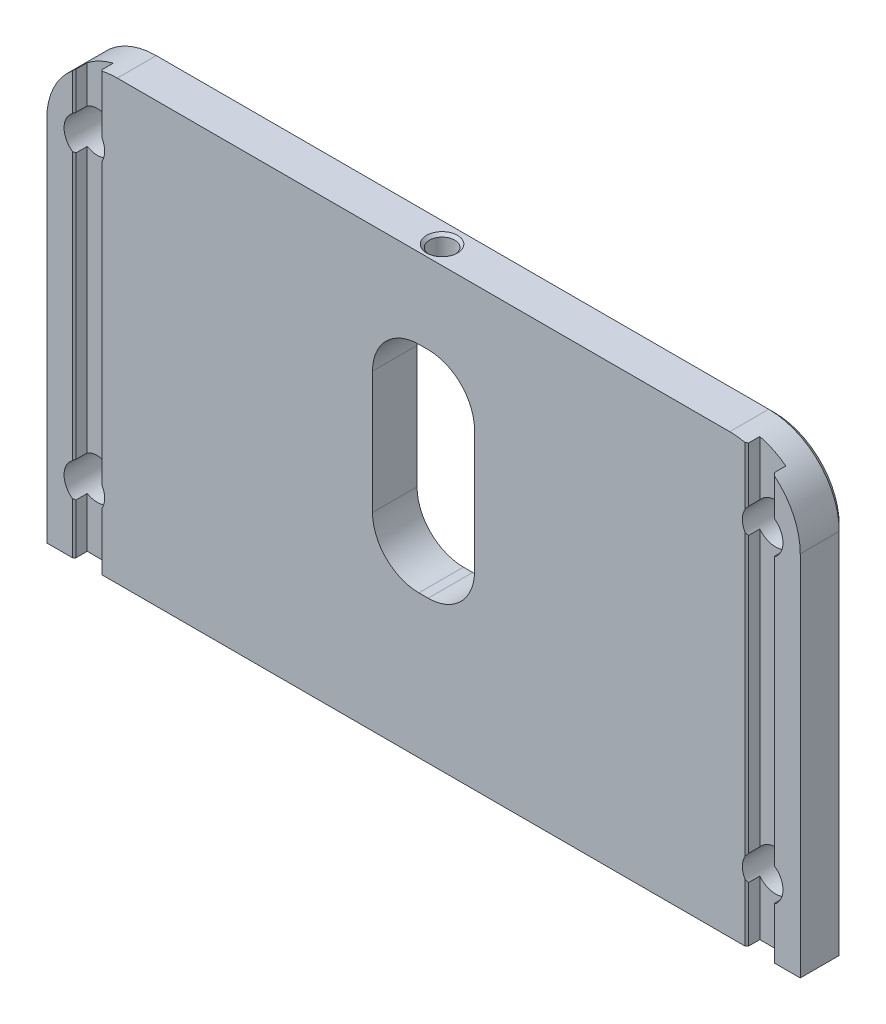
ISO-10303-21;
HEADER;
FILE_DESCRIPTION(('STEP AP214'),'2;1');
FILE_NAME('part.step','',(''),(''),'','','');
FILE_SCHEMA(('AUTOMOTIVE_DESIGN { 1 0 10303 214 1 1 1 1 }'));
ENDSEC;
DATA;
#1=APPLICATION_CONTEXT('core data for automotive mechanical design processes');
#2=APPLICATION_PROTOCOL_DEFINITION('international standard','automotive_design',2000,#1);
#3=PRODUCT_CONTEXT('',#1,'mechanical');
#4=PRODUCT('Part','Part','',(#3));
#5=PRODUCT_RELATED_PRODUCT_CATEGORY('part','',(#4));
#6=PRODUCT_DEFINITION_FORMATION('','',#4);
#7=PRODUCT_DEFINITION_CONTEXT('part definition',#1,'design');
#8=PRODUCT_DEFINITION('design','',#6,#7);
#9=PRODUCT_DEFINITION_SHAPE('','',#8);
#10=(LENGTH_UNIT() NAMED_UNIT(*) SI_UNIT(.MILLI.,.METRE.));
#11=(NAMED_UNIT(*) PLANE_ANGLE_UNIT() SI_UNIT($,.RADIAN.));
#12=(NAMED_UNIT(*) SI_UNIT($,.STERADIAN.) SOLID_ANGLE_UNIT());
#13=UNCERTAINTY_MEASURE_WITH_UNIT(LENGTH_MEASURE(1.E-05),#10,'distance_accuracy_value','');
#14=(GEOMETRIC_REPRESENTATION_CONTEXT(3) GLOBAL_UNCERTAINTY_ASSIGNED_CONTEXT((#13)) GLOBAL_UNIT_ASSIGNED_CONTEXT((#10,
#11,#12)) REPRESENTATION_CONTEXT('',''));
#15=CARTESIAN_POINT('',(0.,0.,0.));
#16=DIRECTION('',(0.,0.,1.));
#17=DIRECTION('',(1.,0.,0.));
#18=AXIS2_PLACEMENT_3D('',#15,#16,#17);
#19=CARTESIAN_POINT('',(-6.731,49.276,-197.033532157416));
#20=DIRECTION('',(0.,-1.,0.));
#21=DIRECTION('',(0.,0.,-1.));
#22=AXIS2_PLACEMENT_3D('',#19,#20,#21);
#23=PLANE('',#22);
#24=DIRECTION('',(0.,0.,1.));
#25=VECTOR('',#24,1.);
#26=CARTESIAN_POINT('',(0.635,49.276,-16.256));
#27=LINE('',#26,#25);
#28=CARTESIAN_POINT('',(0.635,49.276,-17.1897637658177));
#29=VERTEX_POINT('',#28);
#30=CARTESIAN_POINT('',(0.635,49.276,-16.812359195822));
#31=VERTEX_POINT('',#30);
#32=EDGE_CURVE('E764',#29,#31,#27,.T.);
#33=ORIENTED_EDGE('',*,*,#32,.T.);
#34=CARTESIAN_POINT('',(0.,49.276,-18.796));
#35=DIRECTION('',(0.,-1.,0.));
#36=DIRECTION('',(0.,0.,-1.));
#37=AXIS2_PLACEMENT_3D('',#34,#35,#36);
#38=CIRCLE('',#37,2.0828);
#39=CARTESIAN_POINT('',(-0.635,49.276,-16.812359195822));
#40=VERTEX_POINT('',#39);
#41=EDGE_CURVE('E806',#31,#40,#38,.T.);
#42=ORIENTED_EDGE('',*,*,#41,.T.);
#43=DIRECTION('',(0.,0.,1.));
#44=VECTOR('',#43,1.);
#45=CARTESIAN_POINT('',(-0.635,49.276,-22.352));
#46=LINE('',#45,#44);
#47=CARTESIAN_POINT('',(-0.635,49.276,-17.1897637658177));
#48=VERTEX_POINT('',#47);
#49=EDGE_CURVE('E727',#40,#48,#46,.F.);
#50=ORIENTED_EDGE('',*,*,#49,.T.);
#51=CARTESIAN_POINT('',(0.,49.276,-18.796));
#52=DIRECTION('',(0.,-1.,0.));
#53=DIRECTION('',(0.,0.,-1.));
#54=AXIS2_PLACEMENT_3D('',#51,#52,#53);
#55=CIRCLE('',#54,1.7272);
#56=EDGE_CURVE('E762',#48,#29,#55,.F.);
#57=ORIENTED_EDGE('',*,*,#56,.T.);
#58=EDGE_LOOP('',(#33,#42,#50,#57));
#59=FACE_BOUND('',#58,.T.);
#60=ADVANCED_FACE('F15',(#59),#23,.T.);
#61=DIRECTION('',(0.,0.,1.));
#62=VECTOR('',#61,1.);
#63=CARTESIAN_POINT('',(-0.635,49.276,-22.352));
#64=LINE('',#63,#62);
#65=CARTESIAN_POINT('',(-0.635,49.276,-20.4022362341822));
#66=VERTEX_POINT('',#65);
#67=CARTESIAN_POINT('',(-0.635,49.276,-20.779640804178));
#68=VERTEX_POINT('',#67);
#69=EDGE_CURVE('E724',#66,#68,#64,.F.);
#70=ORIENTED_EDGE('',*,*,#69,.T.);
#71=CARTESIAN_POINT('',(0.,49.276,-18.796));
#72=DIRECTION('',(0.,-1.,0.));
#73=DIRECTION('',(0.,0.,-1.));
#74=AXIS2_PLACEMENT_3D('',#71,#72,#73);
#75=CIRCLE('',#74,2.0828);
#76=CARTESIAN_POINT('',(0.635,49.276,-20.779640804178));
#77=VERTEX_POINT('',#76);
#78=EDGE_CURVE('E827',#68,#77,#75,.T.);
#79=ORIENTED_EDGE('',*,*,#78,.T.);
#80=DIRECTION('',(0.,0.,1.));
#81=VECTOR('',#80,1.);
#82=CARTESIAN_POINT('',(0.635,49.276,-16.256));
#83=LINE('',#82,#81);
#84=CARTESIAN_POINT('',(0.635,49.276,-20.4022362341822));
#85=VERTEX_POINT('',#84);
#86=EDGE_CURVE('E850',#77,#85,#83,.T.);
#87=ORIENTED_EDGE('',*,*,#86,.T.);
#88=EDGE_CURVE('E887',#85,#66,#55,.F.);
#89=ORIENTED_EDGE('',*,*,#88,.T.);
#90=EDGE_LOOP('',(#70,#79,#87,#89));
#91=FACE_BOUND('',#90,.T.);
#92=ADVANCED_FACE('F772',(#91),#23,.T.);
#93=CARTESIAN_POINT('',(0.635,42.926,-197.033532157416));
#94=DIRECTION('',(0.,0.,-1.));
#95=DIRECTION('',(-1.,0.,0.));
#96=AXIS2_PLACEMENT_3D('',#93,#94,#95);
#97=CYLINDRICAL_SURFACE('',#96,6.35);
#98=CARTESIAN_POINT('',(0.635,49.276,-16.812359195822));
#99=CARTESIAN_POINT('',(0.69008338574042,49.2760034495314,-16.8299914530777));
#100=CARTESIAN_POINT('',(0.744401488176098,49.2752826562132,-16.849911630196));
#101=CARTESIAN_POINT('',(0.851154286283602,49.2725439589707,-16.8941765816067));
#102=CARTESIAN_POINT('',(0.903589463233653,49.270526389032,-16.9185202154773));
#103=CARTESIAN_POINT('',(1.05730986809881,49.2627686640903,-16.9978337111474));
#104=CARTESIAN_POINT('',(1.15530731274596,49.25532188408,-17.0591818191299));
#105=CARTESIAN_POINT('',(1.33955738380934,49.2374734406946,-17.1969714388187));
#106=CARTESIAN_POINT('',(1.42581564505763,49.227073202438,-17.2734056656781));
#107=CARTESIAN_POINT('',(1.58454600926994,49.2051152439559,-17.439367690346));
#108=CARTESIAN_POINT('',(1.65701363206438,49.1935571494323,-17.5288997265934));
#109=CARTESIAN_POINT('',(1.78764917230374,49.1708704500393,-17.7207664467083));
#110=CARTESIAN_POINT('',(1.8454766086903,49.1597563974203,-17.8233347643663));
#111=CARTESIAN_POINT('',(1.94309819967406,49.1400056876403,-18.0369249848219));
#112=CARTESIAN_POINT('',(1.9829015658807,49.1313677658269,-18.1479425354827));
#113=CARTESIAN_POINT('',(2.03609087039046,49.1195467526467,-18.3482937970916));
#114=CARTESIAN_POINT('',(2.05350162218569,49.115556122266,-18.4365324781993));
#115=CARTESIAN_POINT('',(2.07682999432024,49.1101459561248,-18.6145571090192));
#116=CARTESIAN_POINT('',(2.08275191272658,49.10872545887,-18.7043424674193));
#117=CARTESIAN_POINT('',(2.0827992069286,49.1087483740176,-18.7941824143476));
#118=B_SPLINE_CURVE_WITH_KNOTS('',3,(#98,#99,#100,#101,#102,#103,#104,#105,#106,#107,#108,#109,
#110,#111,#112,#113,#114,#115,#116,#117),.UNSPECIFIED.,.F.,.F.,(4,2,2,2,2,2,2,2,2,4),(0.,
0.173395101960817,0.346745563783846,0.692521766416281,1.03813140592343,1.38385313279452,
1.73699872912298,2.08996363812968,2.35929463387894,2.62852485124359),.UNSPECIFIED.);
#119=CARTESIAN_POINT('',(2.0827992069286,49.1087483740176,-18.7941824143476));
#120=VERTEX_POINT('',#119);
#121=EDGE_CURVE('E805',#31,#120,#118,.T.);
#122=ORIENTED_EDGE('',*,*,#121,.F.);
#123=ORIENTED_EDGE('',*,*,#32,.F.);
#124=CARTESIAN_POINT('',(0.635,49.276,-20.4022362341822));
#125=CARTESIAN_POINT('',(0.67987144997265,49.2760021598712,-20.3844973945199));
#126=CARTESIAN_POINT('',(0.72397534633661,49.2755240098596,-20.3648858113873));
#127=CARTESIAN_POINT('',(0.810368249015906,49.2737246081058,-20.3220566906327));
#128=CARTESIAN_POINT('',(0.852657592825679,49.2724035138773,-20.2988398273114));
#129=CARTESIAN_POINT('',(0.976224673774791,49.267359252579,-20.2240910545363));
#130=CARTESIAN_POINT('',(1.05440440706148,49.2625540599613,-20.1673804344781));
#131=CARTESIAN_POINT('',(1.20012297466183,49.2512272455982,-20.0418672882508));
#132=CARTESIAN_POINT('',(1.26766290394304,49.2447058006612,-19.9730660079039));
#133=CARTESIAN_POINT('',(1.39037849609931,49.2312136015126,-19.8252193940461));
#134=CARTESIAN_POINT('',(1.44555311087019,49.2242428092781,-19.7461731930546));
#135=CARTESIAN_POINT('',(1.54261923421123,49.2109954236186,-19.5789473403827));
#136=CARTESIAN_POINT('',(1.58434050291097,49.204728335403,-19.4906680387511));
#137=CARTESIAN_POINT('',(1.65236334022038,49.1940671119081,-19.3082402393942));
#138=CARTESIAN_POINT('',(1.67866475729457,49.1896729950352,-19.2140916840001));
#139=CARTESIAN_POINT('',(1.71491969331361,49.1835245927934,-19.0232488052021));
#140=CARTESIAN_POINT('',(1.7249789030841,49.1817532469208,-18.9265751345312));
#141=CARTESIAN_POINT('',(1.72876192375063,49.1810930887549,-18.7329056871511));
#142=CARTESIAN_POINT('',(1.72248730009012,49.1822040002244,-18.6359099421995));
#143=CARTESIAN_POINT('',(1.69396871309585,49.1870931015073,-18.4454935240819));
#144=CARTESIAN_POINT('',(1.67190566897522,49.1908410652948,-18.3520448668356));
#145=CARTESIAN_POINT('',(1.61267400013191,49.2003562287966,-18.1701814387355));
#146=CARTESIAN_POINT('',(1.57550551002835,49.2061234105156,-18.0817666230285));
#147=CARTESIAN_POINT('',(1.48674868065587,49.2187770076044,-17.9116467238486));
#148=CARTESIAN_POINT('',(1.43504291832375,49.2256723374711,-17.830003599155));
#149=CARTESIAN_POINT('',(1.3187184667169,49.2393547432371,-17.6764083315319));
#150=CARTESIAN_POINT('',(1.25409184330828,49.246141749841,-17.6044621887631));
#151=CARTESIAN_POINT('',(1.11290571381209,49.2583914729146,-17.4715482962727));
#152=CARTESIAN_POINT('',(1.03622058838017,49.2638384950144,-17.4107126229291));
#153=CARTESIAN_POINT('',(0.873708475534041,49.2720288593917,-17.3029110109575));
#154=CARTESIAN_POINT('',(0.787905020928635,49.2747789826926,-17.255910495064));
#155=CARTESIAN_POINT('',(0.677753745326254,49.2758921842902,-17.2071608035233));
#156=CARTESIAN_POINT('',(0.656458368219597,49.2760015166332,-17.1982436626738));
#157=CARTESIAN_POINT('',(0.635,49.276,-17.1897637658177));
#158=B_SPLINE_CURVE_WITH_KNOTS('',3,(#124,#125,#126,#127,#128,#129,#130,#131,#132,#133,#134,
#135,#136,#137,#138,#139,#140,#141,#142,#143,#144,#145,#146,#147,#148,#149,#150,#151,#152,#153,
#154,#155,#156,#157),.UNSPECIFIED.,.F.,.F.,(4,2,2,2,2,2,2,2,2,2,2,2,2,2,2,2,4),(0.,
0.144657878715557,0.289288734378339,0.57790393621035,0.866489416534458,1.15509934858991,
1.44722980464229,1.73936313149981,2.02958772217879,2.31978449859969,2.60670809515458,
2.89362913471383,3.18293783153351,3.47242472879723,3.76515602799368,4.05714938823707,
4.12638972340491),.UNSPECIFIED.);
#159=EDGE_CURVE('E685',#85,#29,#158,.T.);
#160=ORIENTED_EDGE('',*,*,#159,.F.);
#161=ORIENTED_EDGE('',*,*,#86,.F.);
#162=CARTESIAN_POINT('',(2.0828,49.1087481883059,-18.796));
#163=CARTESIAN_POINT('',(2.08280054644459,49.1087432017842,-18.8538939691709));
#164=CARTESIAN_POINT('',(2.08038462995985,49.1093143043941,-18.9117592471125));
#165=CARTESIAN_POINT('',(2.07075271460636,49.1115598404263,-19.0270578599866));
#166=CARTESIAN_POINT('',(2.06353751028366,49.1132340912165,-19.0844912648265));
#167=CARTESIAN_POINT('',(2.03479195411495,49.1198269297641,-19.2553080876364));
#168=CARTESIAN_POINT('',(2.00616125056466,49.1263161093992,-19.3675192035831));
#169=CARTESIAN_POINT('',(1.93086713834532,49.1424853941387,-19.5853741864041));
#170=CARTESIAN_POINT('',(1.88420618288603,49.152165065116,-19.6910189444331));
#171=CARTESIAN_POINT('',(1.7741766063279,49.1732317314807,-19.8930801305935));
#172=CARTESIAN_POINT('',(1.71080251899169,49.1846192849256,-19.9894935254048));
#173=CARTESIAN_POINT('',(1.56780007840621,49.207536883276,-20.1721353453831));
#174=CARTESIAN_POINT('',(1.4879083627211,49.2190659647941,-20.2581576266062));
#175=CARTESIAN_POINT('',(1.31469470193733,49.2401196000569,-20.415666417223));
#176=CARTESIAN_POINT('',(1.22138029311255,49.2496452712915,-20.487161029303));
#177=CARTESIAN_POINT('',(1.04686523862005,49.263083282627,-20.5988377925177));
#178=CARTESIAN_POINT('',(0.967890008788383,49.2677857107,-20.6424355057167));
#179=CARTESIAN_POINT('',(0.804897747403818,49.2742578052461,-20.7191064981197));
#180=CARTESIAN_POINT('',(0.720881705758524,49.2760280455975,-20.7521818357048));
#181=CARTESIAN_POINT('',(0.635,49.276,-20.779640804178));
#182=B_SPLINE_CURVE_WITH_KNOTS('',3,(#162,#163,#164,#165,#166,#167,#168,#169,#170,#171,#172,
#173,#174,#175,#176,#177,#178,#179,#180,#181),.UNSPECIFIED.,.F.,.F.,(4,2,2,2,2,2,2,2,2,4),(0.,
0.173572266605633,0.347115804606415,0.69328177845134,1.0394006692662,1.38563290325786,
1.73788280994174,2.08993570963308,2.36016289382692,2.63033718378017),.UNSPECIFIED.);
#183=CARTESIAN_POINT('',(2.0828,49.1087481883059,-18.796));
#184=VERTEX_POINT('',#183);
#185=EDGE_CURVE('E798',#184,#77,#182,.T.);
#186=ORIENTED_EDGE('',*,*,#185,.F.);
#187=CARTESIAN_POINT('',(0.635,42.926,-18.796));
#188=DIRECTION('',(0.,0.,1.));
#189=DIRECTION('',(1.,0.,0.));
#190=AXIS2_PLACEMENT_3D('',#187,#188,#189);
#191=CIRCLE('',#190,6.35);
#192=CARTESIAN_POINT('',(2.083054,49.1086887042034,-18.796));
#193=VERTEX_POINT('',#192);
#194=EDGE_CURVE('E868',#193,#184,#191,.T.);
#195=ORIENTED_EDGE('',*,*,#194,.F.);
#196=CARTESIAN_POINT('',(2.083054,49.1086887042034,-18.796));
#197=CARTESIAN_POINT('',(2.08305454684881,49.1086837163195,-18.8539007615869));
#198=CARTESIAN_POINT('',(2.08063835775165,49.10925498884,-18.9117728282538));
#199=CARTESIAN_POINT('',(2.07100535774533,49.1115011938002,-19.0270849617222));
#200=CARTESIAN_POINT('',(2.06378934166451,49.1131759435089,-19.0845250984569));
#201=CARTESIAN_POINT('',(2.03504056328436,49.1197707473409,-19.2553618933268));
#202=CARTESIAN_POINT('',(2.00640666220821,49.1262618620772,-19.3675861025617));
#203=CARTESIAN_POINT('',(1.93110419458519,49.1424360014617,-19.5854664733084));
#204=CARTESIAN_POINT('',(1.88443808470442,49.1521185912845,-19.691123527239));
#205=CARTESIAN_POINT('',(1.77439639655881,49.1731917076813,-19.893208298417));
#206=CARTESIAN_POINT('',(1.71101534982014,49.1845827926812,-19.9896329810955));
#207=CARTESIAN_POINT('',(1.5679967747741,49.2075077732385,-20.1722968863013));
#208=CARTESIAN_POINT('',(1.48809576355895,49.2190407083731,-20.2583298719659));
#209=CARTESIAN_POINT('',(1.31486181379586,49.2401017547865,-20.4158584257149));
#210=CARTESIAN_POINT('',(1.22153641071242,49.24963098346,-20.4873620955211));
#211=CARTESIAN_POINT('',(1.04698802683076,49.263075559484,-20.5990612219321));
#212=CARTESIAN_POINT('',(0.967989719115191,49.2677807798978,-20.6426710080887));
#213=CARTESIAN_POINT('',(0.804949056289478,49.274256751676,-20.7193613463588));
#214=CARTESIAN_POINT('',(0.720907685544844,49.2760280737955,-20.7524439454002));
#215=CARTESIAN_POINT('',(0.635,49.276,-20.7799074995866));
#216=B_SPLINE_CURVE_WITH_KNOTS('',3,(#196,#197,#198,#199,#200,#201,#202,#203,#204,#205,#206,
#207,#208,#209,#210,#211,#212,#213,#214,#215),.UNSPECIFIED.,.F.,.F.,(4,2,2,2,2,2,2,2,2,4),(0.,
0.173592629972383,0.347156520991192,0.693362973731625,1.03952227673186,1.38579497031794,
1.73808811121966,2.09018426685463,2.3604893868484,2.63074191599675),.UNSPECIFIED.);
#217=CARTESIAN_POINT('',(0.635,49.276,-20.7799074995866));
#218=VERTEX_POINT('',#217);
#219=EDGE_CURVE('E783',#193,#218,#216,.T.);
#220=ORIENTED_EDGE('',*,*,#219,.T.);
#221=CARTESIAN_POINT('',(0.635,49.276,-22.352));
#222=VERTEX_POINT('',#221);
#223=EDGE_CURVE('E708',#222,#218,#83,.T.);
#224=ORIENTED_EDGE('',*,*,#223,.F.);
#225=CARTESIAN_POINT('',(0.635,42.926,-22.352));
#226=DIRECTION('',(0.,0.,-1.));
#227=DIRECTION('',(-1.,0.,0.));
#228=AXIS2_PLACEMENT_3D('',#225,#226,#227);
#229=CIRCLE('',#228,6.35);
#230=CARTESIAN_POINT('',(6.985,42.926,-22.352));
#231=VERTEX_POINT('',#230);
#232=EDGE_CURVE('E865',#231,#222,#229,.F.);
#233=ORIENTED_EDGE('',*,*,#232,.F.);
#234=DIRECTION('',(0.,0.,1.));
#235=VECTOR('',#234,1.);
#236=CARTESIAN_POINT('',(6.985,42.926,-22.352));
#237=LINE('',#236,#235);
#238=CARTESIAN_POINT('',(6.985,42.926,-16.256));
#239=VERTEX_POINT('',#238);
#240=EDGE_CURVE('E950',#239,#231,#237,.F.);
#241=ORIENTED_EDGE('',*,*,#240,.F.);
#242=CARTESIAN_POINT('',(0.635,42.926,-16.256));
#243=DIRECTION('',(0.,0.,1.));
#244=DIRECTION('',(1.,0.,0.));
#245=AXIS2_PLACEMENT_3D('',#242,#243,#244);
#246=CIRCLE('',#245,6.35);
#247=CARTESIAN_POINT('',(0.635,49.276,-16.256));
#248=VERTEX_POINT('',#247);
#249=EDGE_CURVE('E955',#248,#239,#246,.F.);
#250=ORIENTED_EDGE('',*,*,#249,.F.);
#251=CARTESIAN_POINT('',(0.635,49.276,-16.8120925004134));
#252=VERTEX_POINT('',#251);
#253=EDGE_CURVE('E844',#252,#248,#27,.T.);
#254=ORIENTED_EDGE('',*,*,#253,.F.);
#255=CARTESIAN_POINT('',(0.635,49.276,-16.8120925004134));
#256=CARTESIAN_POINT('',(0.690090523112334,49.2760034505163,-16.8297246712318));
#257=CARTESIAN_POINT('',(0.744415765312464,49.2752824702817,-16.8496450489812));
#258=CARTESIAN_POINT('',(0.851182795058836,49.2725430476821,-16.8939109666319));
#259=CARTESIAN_POINT('',(0.90362506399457,49.270524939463,-16.9182553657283));
#260=CARTESIAN_POINT('',(1.05736653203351,49.2627651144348,-16.9975719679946));
#261=CARTESIAN_POINT('',(1.15537781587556,49.2553162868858,-17.0589232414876));
#262=CARTESIAN_POINT('',(1.33965479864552,49.237462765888,-17.1967212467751));
#263=CARTESIAN_POINT('',(1.42592613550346,49.2270594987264,-17.2731606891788));
#264=CARTESIAN_POINT('',(1.58468168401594,49.2050948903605,-17.4391350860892));
#265=CARTESIAN_POINT('',(1.65716141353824,49.1935331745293,-17.5286742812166));
#266=CARTESIAN_POINT('',(1.78782065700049,49.170838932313,-17.7205579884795));
#267=CARTESIAN_POINT('',(1.8456595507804,49.1597209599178,-17.823136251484));
#268=CARTESIAN_POINT('',(1.9433022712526,49.1399628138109,-18.0367482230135));
#269=CARTESIAN_POINT('',(1.98311530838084,49.1313213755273,-18.1477775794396));
#270=CARTESIAN_POINT('',(2.03632360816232,49.1194941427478,-18.3481654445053));
#271=CARTESIAN_POINT('',(2.0537422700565,49.1155009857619,-18.4364290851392));
#272=CARTESIAN_POINT('',(2.0770812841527,49.1100873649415,-18.6145047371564));
#273=CARTESIAN_POINT('',(2.0830059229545,49.1086659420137,-18.7043161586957));
#274=CARTESIAN_POINT('',(2.08305320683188,49.1086888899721,-18.7941821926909));
#275=B_SPLINE_CURVE_WITH_KNOTS('',3,(#255,#256,#257,#258,#259,#260,#261,#262,#263,#264,#265,
#266,#267,#268,#269,#270,#271,#272,#273,#274),.UNSPECIFIED.,.F.,.F.,(4,2,2,2,2,2,2,2,2,4),(0.,
0.173415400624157,0.346786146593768,0.692602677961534,1.03825254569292,1.38401455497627,
1.73720373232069,2.09021224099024,2.35962104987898,2.62892936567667),.UNSPECIFIED.);
#276=CARTESIAN_POINT('',(2.08305320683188,49.1086888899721,-18.7941821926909));
#277=VERTEX_POINT('',#276);
#278=EDGE_CURVE('E791',#252,#277,#275,.T.);
#279=ORIENTED_EDGE('',*,*,#278,.T.);
#280=CARTESIAN_POINT('',(0.635,42.926,-18.7954458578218));
#281=DIRECTION('',(-0.000872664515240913,0.,0.99999961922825));
#282=DIRECTION('',(-0.99999961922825,0.,-0.000872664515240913));
#283=AXIS2_PLACEMENT_3D('',#280,#281,#282);
#284=ELLIPSE('',#283,6.35000241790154,6.35);
#285=EDGE_CURVE('E424',#120,#277,#284,.F.);
#286=ORIENTED_EDGE('',*,*,#285,.F.);
#287=EDGE_LOOP('',(#122,#123,#160,#161,#186,#195,#220,#224,#233,#241,#250,#254,#279,#286));
#288=FACE_BOUND('',#287,.T.);
#289=ADVANCED_FACE('F766',(#288),#97,.F.);
#290=CARTESIAN_POINT('',(-0.635,42.926,-197.033532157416));
#291=DIRECTION('',(0.,0.,-1.));
#292=DIRECTION('',(-1.,0.,0.));
#293=AXIS2_PLACEMENT_3D('',#290,#291,#292);
#294=CYLINDRICAL_SURFACE('',#293,6.35);
#295=CARTESIAN_POINT('',(-0.635,49.276,-20.779640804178));
#296=CARTESIAN_POINT('',(-0.690086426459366,49.2760034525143,-20.7620075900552));
#297=CARTESIAN_POINT('',(-0.744407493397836,49.2752825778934,-20.7420861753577));
#298=CARTESIAN_POINT('',(-0.851165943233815,49.2725435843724,-20.6978182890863));
#299=CARTESIAN_POINT('',(-0.90360380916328,49.2705258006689,-20.6734729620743));
#300=CARTESIAN_POINT('',(-1.05732064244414,49.2627678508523,-20.5941595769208));
#301=CARTESIAN_POINT('',(-1.15531233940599,49.2553214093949,-20.5328145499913));
#302=CARTESIAN_POINT('',(-1.33955807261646,49.2374733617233,-20.3950279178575));
#303=CARTESIAN_POINT('',(-1.42581701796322,49.2270729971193,-20.3185926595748));
#304=CARTESIAN_POINT('',(-1.58454693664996,49.2051151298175,-20.1526315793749));
#305=CARTESIAN_POINT('',(-1.65701362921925,49.1935572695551,-20.0631017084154));
#306=CARTESIAN_POINT('',(-1.78763423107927,49.1708729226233,-19.8712540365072));
#307=CARTESIAN_POINT('',(-1.84545140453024,49.1597608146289,-19.7687049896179));
#308=CARTESIAN_POINT('',(-1.94307761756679,49.1400105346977,-19.5551354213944));
#309=CARTESIAN_POINT('',(-1.98288745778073,49.1313722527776,-19.4441152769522));
#310=CARTESIAN_POINT('',(-2.04307590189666,49.1179930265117,-19.2173906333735));
#311=CARTESIAN_POINT('',(-2.06356739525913,49.1132294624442,-19.101717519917));
#312=CARTESIAN_POINT('',(-2.08482790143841,49.1082830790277,-18.8684885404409));
#313=CARTESIAN_POINT('',(-2.08560078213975,49.1080993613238,-18.7509330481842));
#314=CARTESIAN_POINT('',(-2.06762142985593,49.1122889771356,-18.5201685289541));
#315=CARTESIAN_POINT('',(-2.04932160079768,49.1165567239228,-18.4069219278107));
#316=CARTESIAN_POINT('',(-1.99448396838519,49.1288287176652,-18.185148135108));
#317=CARTESIAN_POINT('',(-1.95794466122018,49.1368332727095,-18.0766213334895));
#318=CARTESIAN_POINT('',(-1.86739334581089,49.1554339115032,-17.8664356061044));
#319=CARTESIAN_POINT('',(-1.813257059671,49.166048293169,-17.7648319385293));
#320=CARTESIAN_POINT('',(-1.68905873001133,49.1882221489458,-17.5719502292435));
#321=CARTESIAN_POINT('',(-1.61899141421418,49.19978193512,-17.4806756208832));
#322=CARTESIAN_POINT('',(-1.46289672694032,49.2223041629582,-17.3087904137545));
#323=CARTESIAN_POINT('',(-1.37652722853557,49.2332456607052,-17.2284876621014));
#324=CARTESIAN_POINT('',(-1.19132791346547,49.2522642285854,-17.0835209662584));
#325=CARTESIAN_POINT('',(-1.09251247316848,49.2603445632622,-17.0188392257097));
#326=CARTESIAN_POINT('',(-0.932429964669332,49.2692839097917,-16.9324642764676));
#327=CARTESIAN_POINT('',(-0.874506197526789,49.2717558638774,-16.9045931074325));
#328=CARTESIAN_POINT('',(-0.756367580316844,49.2751159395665,-16.8543305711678));
#329=CARTESIAN_POINT('',(-0.696155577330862,49.2760059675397,-16.8319326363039));
#330=CARTESIAN_POINT('',(-0.635,49.276,-16.812359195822));
#331=B_SPLINE_CURVE_WITH_KNOTS('',3,(#295,#296,#297,#298,#299,#300,#301,#302,#303,#304,#305,
#306,#307,#308,#309,#310,#311,#312,#313,#314,#315,#316,#317,#318,#319,#320,#321,#322,#323,#324,
#325,#326,#327,#328,#329,#330),.UNSPECIFIED.,.F.,.F.,(4,2,2,2,2,2,2,2,2,2,2,2,2,2,2,2,2,4),(0.,
0.17340468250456,0.346764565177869,0.692521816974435,1.03813395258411,1.38385318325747,
1.73691628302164,2.08996368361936,2.440934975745,2.79183742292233,3.13460186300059,
3.47739456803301,3.82266283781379,4.16804553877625,4.52170219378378,4.87495402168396,
5.06767515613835,5.2601638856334),.UNSPECIFIED.);
#332=EDGE_CURVE('E822',#68,#40,#331,.T.);
#333=ORIENTED_EDGE('',*,*,#332,.F.);
#334=ORIENTED_EDGE('',*,*,#69,.F.);
#335=CARTESIAN_POINT('',(-0.635,49.276,-17.1897637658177));
#336=CARTESIAN_POINT('',(-0.679871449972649,49.2760021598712,-17.2075026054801));
#337=CARTESIAN_POINT('',(-0.723975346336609,49.2755240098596,-17.2271141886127));
#338=CARTESIAN_POINT('',(-0.810368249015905,49.2737246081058,-17.2699433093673));
#339=CARTESIAN_POINT('',(-0.852657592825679,49.2724035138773,-17.2931601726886));
#340=CARTESIAN_POINT('',(-0.976224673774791,49.267359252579,-17.3679089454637));
#341=CARTESIAN_POINT('',(-1.05440440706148,49.2625540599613,-17.4246195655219));
#342=CARTESIAN_POINT('',(-1.20012297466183,49.2512272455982,-17.5501327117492));
#343=CARTESIAN_POINT('',(-1.26766290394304,49.2447058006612,-17.6189339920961));
#344=CARTESIAN_POINT('',(-1.39037849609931,49.2312136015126,-17.7667806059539));
#345=CARTESIAN_POINT('',(-1.44555311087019,49.2242428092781,-17.8458268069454));
#346=CARTESIAN_POINT('',(-1.54261923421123,49.2109954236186,-18.0130526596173));
#347=CARTESIAN_POINT('',(-1.58434050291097,49.204728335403,-18.1013319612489));
#348=CARTESIAN_POINT('',(-1.65236334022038,49.1940671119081,-18.2837597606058));
#349=CARTESIAN_POINT('',(-1.67866475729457,49.1896729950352,-18.3779083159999));
#350=CARTESIAN_POINT('',(-1.71491969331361,49.1835245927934,-18.5687511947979));
#351=CARTESIAN_POINT('',(-1.7249789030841,49.1817532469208,-18.6654248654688));
#352=CARTESIAN_POINT('',(-1.72876192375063,49.1810930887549,-18.8590943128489));
#353=CARTESIAN_POINT('',(-1.72248730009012,49.1822040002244,-18.9560900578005));
#354=CARTESIAN_POINT('',(-1.69396871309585,49.1870931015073,-19.1465064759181));
#355=CARTESIAN_POINT('',(-1.67190566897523,49.1908410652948,-19.2399551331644));
#356=CARTESIAN_POINT('',(-1.61267400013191,49.2003562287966,-19.4218185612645));
#357=CARTESIAN_POINT('',(-1.57550551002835,49.2061234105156,-19.5102333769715));
#358=CARTESIAN_POINT('',(-1.48674868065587,49.2187770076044,-19.6803532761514));
#359=CARTESIAN_POINT('',(-1.43504291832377,49.2256723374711,-19.761996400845));
#360=CARTESIAN_POINT('',(-1.31871846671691,49.2393547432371,-19.9155916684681));
#361=CARTESIAN_POINT('',(-1.25409184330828,49.246141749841,-19.9875378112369));
#362=CARTESIAN_POINT('',(-1.11290571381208,49.2583914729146,-20.1204517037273));
#363=CARTESIAN_POINT('',(-1.03622058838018,49.2638384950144,-20.1812873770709));
#364=CARTESIAN_POINT('',(-0.873708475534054,49.2720288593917,-20.2890889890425));
#365=CARTESIAN_POINT('',(-0.787905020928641,49.2747789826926,-20.336089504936));
#366=CARTESIAN_POINT('',(-0.677753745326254,49.2758921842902,-20.3848391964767));
#367=CARTESIAN_POINT('',(-0.656458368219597,49.2760015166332,-20.3937563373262));
#368=CARTESIAN_POINT('',(-0.635,49.276,-20.4022362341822));
#369=B_SPLINE_CURVE_WITH_KNOTS('',3,(#335,#336,#337,#338,#339,#340,#341,#342,#343,#344,#345,
#346,#347,#348,#349,#350,#351,#352,#353,#354,#355,#356,#357,#358,#359,#360,#361,#362,#363,#364,
#365,#366,#367,#368),.UNSPECIFIED.,.F.,.F.,(4,2,2,2,2,2,2,2,2,2,2,2,2,2,2,2,4),(0.,
0.144657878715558,0.28928873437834,0.57790393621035,0.86648941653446,1.15509934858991,
1.44722980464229,1.73936313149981,2.02958772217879,2.31978449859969,2.60670809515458,
2.89362913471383,3.18293783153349,3.4724247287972,3.76515602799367,4.05714938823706,
4.1263897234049),.UNSPECIFIED.);
#370=EDGE_CURVE('E602',#48,#66,#369,.T.);
#371=ORIENTED_EDGE('',*,*,#370,.F.);
#372=ORIENTED_EDGE('',*,*,#49,.F.);
#373=EDGE_LOOP('',(#333,#334,#371,#372));
#374=FACE_BOUND('',#373,.T.);
#375=ADVANCED_FACE('F771',(#374),#294,.F.);
#376=CARTESIAN_POINT('',(0.,60.198,-18.796));
#377=DIRECTION('',(0.,1.,0.));
#378=DIRECTION('',(0.,0.,1.));
#379=AXIS2_PLACEMENT_3D('',#376,#377,#378);
#380=CONICAL_SURFACE('',#379,2.1082,0.78539816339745);
#381=CARTESIAN_POINT('',(0.,60.198,-18.796));
#382=DIRECTION('',(0.,1.,0.));
#383=DIRECTION('',(-1.,0.,0.));
#384=AXIS2_PLACEMENT_3D('',#381,#382,#383);
#385=CIRCLE('',#384,2.1082);
#386=CARTESIAN_POINT('',(-2.1082,60.198,-18.796));
#387=VERTEX_POINT('',#386);
#388=EDGE_CURVE('E431',#387,#387,#385,.F.);
#389=ORIENTED_EDGE('',*,*,#388,.F.);
#390=EDGE_LOOP('',(#389));
#391=FACE_BOUND('',#390,.T.);
#392=CARTESIAN_POINT('',(0.,59.817,-18.796));
#393=DIRECTION('',(0.,1.,0.));
#394=DIRECTION('',(0.,0.,1.));
#395=AXIS2_PLACEMENT_3D('',#392,#393,#394);
#396=CIRCLE('',#395,1.7272);
#397=CARTESIAN_POINT('',(0.,59.817,-17.0688));
#398=VERTEX_POINT('',#397);
#399=EDGE_CURVE('E417',#398,#398,#396,.T.);
#400=ORIENTED_EDGE('',*,*,#399,.F.);
#401=EDGE_LOOP('',(#400));
#402=FACE_BOUND('',#401,.T.);
#403=DIRECTION('',(0.707106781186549,0.707106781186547,0.));
#404=VECTOR('',#403,1.);
#405=CARTESIAN_POINT('',(0.,58.0898,-18.796));
#406=LINE('',#405,#404);
#407=CARTESIAN_POINT('',(2.083054,60.172854,-18.796));
#408=VERTEX_POINT('',#407);
#409=CARTESIAN_POINT('',(2.0828,60.1726,-18.796));
#410=VERTEX_POINT('',#409);
#411=EDGE_CURVE('E23',#408,#410,#406,.F.);
#412=ORIENTED_EDGE('',*,*,#411,.T.);
#413=CARTESIAN_POINT('',(0.,60.1726,-18.796));
#414=DIRECTION('',(0.,1.,0.));
#415=DIRECTION('',(0.,0.,1.));
#416=AXIS2_PLACEMENT_3D('',#413,#414,#415);
#417=CIRCLE('',#416,2.0828);
#418=CARTESIAN_POINT('',(2.0827992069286,60.1726,-18.7941824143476));
#419=VERTEX_POINT('',#418);
#420=EDGE_CURVE('E9',#410,#419,#417,.T.);
#421=ORIENTED_EDGE('',*,*,#420,.T.);
#422=DIRECTION('',(0.707106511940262,0.707106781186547,0.000617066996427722));
#423=VECTOR('',#422,1.);
#424=CARTESIAN_POINT('',(0.,58.0898,-18.796));
#425=LINE('',#424,#423);
#426=CARTESIAN_POINT('',(2.08305320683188,60.172854,-18.7941821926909));
#427=VERTEX_POINT('',#426);
#428=EDGE_CURVE('E416',#419,#427,#425,.T.);
#429=ORIENTED_EDGE('',*,*,#428,.T.);
#430=CARTESIAN_POINT('',(0.,60.172854,-18.796));
#431=DIRECTION('',(0.,1.,0.));
#432=DIRECTION('',(0.,0.,1.));
#433=AXIS2_PLACEMENT_3D('',#430,#431,#432);
#434=CIRCLE('',#433,2.083054);
#435=EDGE_CURVE('E408',#408,#427,#434,.T.);
#436=ORIENTED_EDGE('',*,*,#435,.F.);
#437=EDGE_LOOP('',(#412,#421,#429,#436));
#438=FACE_BOUND('',#437,.T.);
#439=ADVANCED_FACE('F426',(#391,#402,#438),#380,.F.);
#440=CARTESIAN_POINT('',(44.2595,60.198,-16.256));
#441=DIRECTION('',(0.,1.,0.));
#442=DIRECTION('',(-1.,0.,0.));
#443=AXIS2_PLACEMENT_3D('',#440,#441,#442);
#444=PLANE('',#443);
#445=ORIENTED_EDGE('',*,*,#388,.T.);
#446=EDGE_LOOP('',(#445));
#447=FACE_BOUND('',#446,.T.);
#448=DIRECTION('',(0.,0.,1.));
#449=VECTOR('',#448,1.);
#450=CARTESIAN_POINT('',(41.9227,60.198,-16.256));
#451=LINE('',#450,#449);
#452=CARTESIAN_POINT('',(41.9227,60.198,-16.256));
#453=VERTEX_POINT('',#452);
#454=CARTESIAN_POINT('',(41.9227,60.198,-21.59));
#455=VERTEX_POINT('',#454);
#456=EDGE_CURVE('E599',#453,#455,#451,.F.);
#457=ORIENTED_EDGE('',*,*,#456,.T.);
#458=DIRECTION('',(-1.,0.,0.));
#459=VECTOR('',#458,1.);
#460=CARTESIAN_POINT('',(44.2595,60.198,-21.59));
#461=LINE('',#460,#459);
#462=CARTESIAN_POINT('',(-41.9227,60.198,-21.59));
#463=VERTEX_POINT('',#462);
#464=EDGE_CURVE('E440',#455,#463,#461,.T.);
#465=ORIENTED_EDGE('',*,*,#464,.T.);
#466=DIRECTION('',(0.,0.,1.));
#467=VECTOR('',#466,1.);
#468=CARTESIAN_POINT('',(-41.9227,60.198,-16.256));
#469=LINE('',#468,#467);
#470=CARTESIAN_POINT('',(-41.9227,60.198,-16.256));
#471=VERTEX_POINT('',#470);
#472=EDGE_CURVE('E597',#463,#471,#469,.T.);
#473=ORIENTED_EDGE('',*,*,#472,.T.);
#474=DIRECTION('',(-1.,0.,0.));
#475=VECTOR('',#474,1.);
#476=CARTESIAN_POINT('',(42.8371,60.198,-16.256));
#477=LINE('',#476,#475);
#478=EDGE_CURVE('E896',#453,#471,#477,.T.);
#479=ORIENTED_EDGE('',*,*,#478,.F.);
#480=EDGE_LOOP('',(#457,#465,#473,#479));
#481=FACE_BOUND('',#480,.T.);
#482=ADVANCED_FACE('F1024',(#447,#481),#444,.T.);
#483=CARTESIAN_POINT('',(-51.5747,60.198,-22.352));
#484=DIRECTION('',(0.,0.,-1.));
#485=DIRECTION('',(-1.,0.,0.));
#486=AXIS2_PLACEMENT_3D('',#483,#484,#485);
#487=PLANE('',#486);
#488=DIRECTION('',(-1.,0.,0.));
#489=VECTOR('',#488,1.);
#490=CARTESIAN_POINT('',(-51.5747,1.0159999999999,-22.352));
#491=LINE('',#490,#489);
#492=CARTESIAN_POINT('',(50.8127,1.016,-22.352));
#493=VERTEX_POINT('',#492);
#494=CARTESIAN_POINT('',(-50.8127,1.0159999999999,-22.352));
#495=VERTEX_POINT('',#494);
#496=EDGE_CURVE('E458',#493,#495,#491,.T.);
#497=ORIENTED_EDGE('',*,*,#496,.T.);
#498=DIRECTION('',(0.,1.,0.));
#499=VECTOR('',#498,1.);
#500=CARTESIAN_POINT('',(-50.8127,60.198,-22.352));
#501=LINE('',#500,#499);
#502=CARTESIAN_POINT('',(-50.8127,50.546,-22.352));
#503=VERTEX_POINT('',#502);
#504=EDGE_CURVE('E447',#495,#503,#501,.T.);
#505=ORIENTED_EDGE('',*,*,#504,.T.);
#506=CARTESIAN_POINT('',(-41.9227,50.546,-22.352));
#507=DIRECTION('',(0.,0.,-1.));
#508=DIRECTION('',(-1.,0.,0.));
#509=AXIS2_PLACEMENT_3D('',#506,#507,#508);
#510=CIRCLE('',#509,8.89);
#511=CARTESIAN_POINT('',(-41.9227,59.436,-22.352));
#512=VERTEX_POINT('',#511);
#513=EDGE_CURVE('E450',#503,#512,#510,.T.);
#514=ORIENTED_EDGE('',*,*,#513,.T.);
#515=DIRECTION('',(1.,0.,0.));
#516=VECTOR('',#515,1.);
#517=CARTESIAN_POINT('',(-51.5747,59.436,-22.352));
#518=LINE('',#517,#516);
#519=CARTESIAN_POINT('',(41.9227,59.436,-22.352));
#520=VERTEX_POINT('',#519);
#521=EDGE_CURVE('E452',#512,#520,#518,.T.);
#522=ORIENTED_EDGE('',*,*,#521,.T.);
#523=CARTESIAN_POINT('',(41.9227,50.546,-22.352));
#524=DIRECTION('',(0.,0.,-1.));
#525=DIRECTION('',(-1.,0.,0.));
#526=AXIS2_PLACEMENT_3D('',#523,#524,#525);
#527=CIRCLE('',#526,8.89);
#528=CARTESIAN_POINT('',(50.8127,50.546,-22.352));
#529=VERTEX_POINT('',#528);
#530=EDGE_CURVE('E454',#520,#529,#527,.T.);
#531=ORIENTED_EDGE('',*,*,#530,.T.);
#532=DIRECTION('',(0.,-1.,0.));
#533=VECTOR('',#532,1.);
#534=CARTESIAN_POINT('',(50.8127,60.198,-22.352));
#535=LINE('',#534,#533);
#536=EDGE_CURVE('E456',#529,#493,#535,.T.);
#537=ORIENTED_EDGE('',*,*,#536,.T.);
#538=EDGE_LOOP('',(#497,#505,#514,#522,#531,#537));
#539=FACE_BOUND('',#538,.T.);
#540=DIRECTION('',(0.,1.,0.));
#541=VECTOR('',#540,1.);
#542=CARTESIAN_POINT('',(6.985,60.198,-22.352));
#543=LINE('',#542,#541);
#544=CARTESIAN_POINT('',(6.985,26.162,-22.352));
#545=VERTEX_POINT('',#544);
#546=EDGE_CURVE('E953',#545,#231,#543,.T.);
#547=ORIENTED_EDGE('',*,*,#546,.T.);
#548=ORIENTED_EDGE('',*,*,#232,.T.);
#549=DIRECTION('',(-1.,0.,0.));
#550=VECTOR('',#549,1.);
#551=CARTESIAN_POINT('',(-51.5747,49.276,-22.352));
#552=LINE('',#551,#550);
#553=CARTESIAN_POINT('',(-0.635,49.276,-22.352));
#554=VERTEX_POINT('',#553);
#555=EDGE_CURVE('E720',#222,#554,#552,.T.);
#556=ORIENTED_EDGE('',*,*,#555,.T.);
#557=CARTESIAN_POINT('',(-0.635,42.926,-22.352));
#558=DIRECTION('',(0.,0.,-1.));
#559=DIRECTION('',(-1.,0.,0.));
#560=AXIS2_PLACEMENT_3D('',#557,#558,#559);
#561=CIRCLE('',#560,6.35);
#562=CARTESIAN_POINT('',(-6.985,42.926,-22.352));
#563=VERTEX_POINT('',#562);
#564=EDGE_CURVE('E721',#554,#563,#561,.F.);
#565=ORIENTED_EDGE('',*,*,#564,.T.);
#566=DIRECTION('',(0.,-1.,0.));
#567=VECTOR('',#566,1.);
#568=CARTESIAN_POINT('',(-6.985,60.198,-22.352));
#569=LINE('',#568,#567);
#570=CARTESIAN_POINT('',(-6.985,26.162,-22.352));
#571=VERTEX_POINT('',#570);
#572=EDGE_CURVE('E716',#563,#571,#569,.T.);
#573=ORIENTED_EDGE('',*,*,#572,.T.);
#574=CARTESIAN_POINT('',(-0.635,26.162,-22.352));
#575=DIRECTION('',(0.,0.,-1.));
#576=DIRECTION('',(-1.,0.,0.));
#577=AXIS2_PLACEMENT_3D('',#574,#575,#576);
#578=CIRCLE('',#577,6.35);
#579=CARTESIAN_POINT('',(-0.635,19.812,-22.352));
#580=VERTEX_POINT('',#579);
#581=EDGE_CURVE('E707',#571,#580,#578,.F.);
#582=ORIENTED_EDGE('',*,*,#581,.T.);
#583=DIRECTION('',(1.,0.,0.));
#584=VECTOR('',#583,1.);
#585=CARTESIAN_POINT('',(-51.5747,19.812,-22.352));
#586=LINE('',#585,#584);
#587=CARTESIAN_POINT('',(0.635,19.812,-22.352));
#588=VERTEX_POINT('',#587);
#589=EDGE_CURVE('E697',#580,#588,#586,.T.);
#590=ORIENTED_EDGE('',*,*,#589,.T.);
#591=CARTESIAN_POINT('',(0.635,26.162,-22.352));
#592=DIRECTION('',(0.,0.,-1.));
#593=DIRECTION('',(-1.,0.,0.));
#594=AXIS2_PLACEMENT_3D('',#591,#592,#593);
#595=CIRCLE('',#594,6.35);
#596=EDGE_CURVE('E957',#588,#545,#595,.F.);
#597=ORIENTED_EDGE('',*,*,#596,.T.);
#598=EDGE_LOOP('',(#547,#548,#556,#565,#573,#582,#590,#597));
#599=FACE_BOUND('',#598,.T.);
#600=CARTESIAN_POINT('',(-46.4312,50.673,-22.352));
#601=DIRECTION('',(0.,0.,-1.));
#602=DIRECTION('',(-1.,0.,0.));
#603=AXIS2_PLACEMENT_3D('',#600,#601,#602);
#604=CIRCLE('',#603,2.778125);
#605=CARTESIAN_POINT('',(-49.209325,50.673,-22.352));
#606=VERTEX_POINT('',#605);
#607=EDGE_CURVE('E681',#606,#606,#604,.T.);
#608=ORIENTED_EDGE('',*,*,#607,.F.);
#609=EDGE_LOOP('',(#608));
#610=FACE_BOUND('',#609,.T.);
#611=CARTESIAN_POINT('',(46.4312,50.673,-22.352));
#612=DIRECTION('',(0.,0.,-1.));
#613=DIRECTION('',(-1.,0.,0.));
#614=AXIS2_PLACEMENT_3D('',#611,#612,#613);
#615=CIRCLE('',#614,2.778125);
#616=CARTESIAN_POINT('',(43.653075,50.673,-22.352));
#617=VERTEX_POINT('',#616);
#618=EDGE_CURVE('E640',#617,#617,#615,.T.);
#619=ORIENTED_EDGE('',*,*,#618,.F.);
#620=EDGE_LOOP('',(#619));
#621=FACE_BOUND('',#620,.T.);
#622=CARTESIAN_POINT('',(46.4312,9.525,-22.352));
#623=DIRECTION('',(0.,0.,-1.));
#624=DIRECTION('',(-1.,0.,0.));
#625=AXIS2_PLACEMENT_3D('',#622,#623,#624);
#626=CIRCLE('',#625,2.778125);
#627=CARTESIAN_POINT('',(43.653075,9.525,-22.352));
#628=VERTEX_POINT('',#627);
#629=EDGE_CURVE('E611',#628,#628,#626,.T.);
#630=ORIENTED_EDGE('',*,*,#629,.F.);
#631=EDGE_LOOP('',(#630));
#632=FACE_BOUND('',#631,.T.);
#633=CARTESIAN_POINT('',(-46.4312,9.525,-22.352));
#634=DIRECTION('',(0.,0.,-1.));
#635=DIRECTION('',(-1.,0.,0.));
#636=AXIS2_PLACEMENT_3D('',#633,#634,#635);
#637=CIRCLE('',#636,2.778125);
#638=CARTESIAN_POINT('',(-49.209325,9.525,-22.352));
#639=VERTEX_POINT('',#638);
#640=EDGE_CURVE('E626',#639,#639,#637,.T.);
#641=ORIENTED_EDGE('',*,*,#640,.F.);
#642=EDGE_LOOP('',(#641));
#643=FACE_BOUND('',#642,.T.);
#644=ADVANCED_FACE('F992',(#539,#599,#610,#621,#632,#643),#487,.T.);
#645=CARTESIAN_POINT('',(0.,49.276,-18.796));
#646=DIRECTION('',(0.,-1.,0.));
#647=DIRECTION('',(0.,0.,-1.));
#648=AXIS2_PLACEMENT_3D('',#645,#646,#647);
#649=CIRCLE('',#648,2.083054);
#650=CARTESIAN_POINT('',(-0.635,49.276,-16.8120925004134));
#651=VERTEX_POINT('',#650);
#652=EDGE_CURVE('E30',#252,#651,#649,.T.);
#653=ORIENTED_EDGE('',*,*,#652,.F.);
#654=ORIENTED_EDGE('',*,*,#253,.T.);
#655=DIRECTION('',(1.,0.,0.));
#656=VECTOR('',#655,1.);
#657=CARTESIAN_POINT('',(42.8371,49.276,-16.256));
#658=LINE('',#657,#656);
#659=CARTESIAN_POINT('',(-0.635,49.276,-16.256));
#660=VERTEX_POINT('',#659);
#661=EDGE_CURVE('E966',#660,#248,#658,.T.);
#662=ORIENTED_EDGE('',*,*,#661,.F.);
#663=EDGE_CURVE('E736',#660,#651,#46,.F.);
#664=ORIENTED_EDGE('',*,*,#663,.T.);
#665=EDGE_LOOP('',(#653,#654,#662,#664));
#666=FACE_BOUND('',#665,.T.);
#667=ADVANCED_FACE('F1002',(#666),#23,.T.);
#668=CARTESIAN_POINT('',(0.,49.276,-18.796));
#669=DIRECTION('',(0.,-1.,0.));
#670=DIRECTION('',(0.,0.,-1.));
#671=AXIS2_PLACEMENT_3D('',#668,#669,#670);
#672=CIRCLE('',#671,2.083054);
#673=CARTESIAN_POINT('',(-0.635,49.276,-20.7799074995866));
#674=VERTEX_POINT('',#673);
#675=EDGE_CURVE('E859',#674,#218,#672,.T.);
#676=ORIENTED_EDGE('',*,*,#675,.F.);
#677=EDGE_CURVE('E728',#674,#554,#64,.F.);
#678=ORIENTED_EDGE('',*,*,#677,.T.);
#679=ORIENTED_EDGE('',*,*,#555,.F.);
#680=ORIENTED_EDGE('',*,*,#223,.T.);
#681=EDGE_LOOP('',(#676,#678,#679,#680));
#682=FACE_BOUND('',#681,.T.);
#683=ADVANCED_FACE('F858',(#682),#23,.T.);
#684=ORIENTED_EDGE('',*,*,#677,.F.);
#685=CARTESIAN_POINT('',(-0.635,49.276,-20.7799074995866));
#686=CARTESIAN_POINT('',(-0.690093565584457,49.2760034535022,-20.7622743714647));
#687=CARTESIAN_POINT('',(-0.744421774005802,49.275282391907,-20.7423527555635));
#688=CARTESIAN_POINT('',(-0.85119445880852,49.2725426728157,-20.698083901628));
#689=CARTESIAN_POINT('',(-0.903639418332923,49.2705243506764,-20.6737378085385));
#690=CARTESIAN_POINT('',(-1.05737731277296,49.2627643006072,-20.5944213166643));
#691=CARTESIAN_POINT('',(-1.15538284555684,49.255315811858,-20.5330731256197));
#692=CARTESIAN_POINT('',(-1.33965548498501,49.237462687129,-20.3952781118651));
#693=CARTESIAN_POINT('',(-1.4259275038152,49.2270592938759,-20.3188376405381));
#694=CARTESIAN_POINT('',(-1.58468260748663,49.2050947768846,-20.1528641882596));
#695=CARTESIAN_POINT('',(-1.65716140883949,49.1935332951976,-20.0633271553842));
#696=CARTESIAN_POINT('',(-1.78780571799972,49.1708414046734,-19.8714624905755));
#697=CARTESIAN_POINT('',(-1.84563435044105,49.1597253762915,-19.7689034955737));
#698=CARTESIAN_POINT('',(-1.94328169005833,49.1399676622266,-19.5553121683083));
#699=CARTESIAN_POINT('',(-1.98310119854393,49.1313258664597,-19.4442802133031));
#700=CARTESIAN_POINT('',(-2.04330686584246,49.117940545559,-19.2175302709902));
#701=CARTESIAN_POINT('',(-2.06380589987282,49.1131744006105,-19.1018436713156));
#702=CARTESIAN_POINT('',(-2.08507906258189,49.1082241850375,-18.8685865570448));
#703=CARTESIAN_POINT('',(-2.08585706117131,49.1080392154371,-18.7510164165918));
#704=CARTESIAN_POINT('',(-2.06788534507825,49.112227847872,-18.5202234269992));
#705=CARTESIAN_POINT('',(-2.04958827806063,49.1164957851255,-18.4069630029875));
#706=CARTESIAN_POINT('',(-1.99475400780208,49.1287695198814,-18.1851613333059));
#707=CARTESIAN_POINT('',(-1.95821529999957,49.1367756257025,-18.0766204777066));
#708=CARTESIAN_POINT('',(-1.86766315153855,49.1553805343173,-17.8664069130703));
#709=CARTESIAN_POINT('',(-1.81352545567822,49.1659976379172,-17.7647894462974));
#710=CARTESIAN_POINT('',(-1.68932229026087,49.1881778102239,-17.5718805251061));
#711=CARTESIAN_POINT('',(-1.6192515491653,49.1997411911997,-17.4805925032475));
#712=CARTESIAN_POINT('',(-1.46314714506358,49.2222713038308,-17.3086799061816));
#713=CARTESIAN_POINT('',(-1.37677116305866,49.233217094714,-17.2283633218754));
#714=CARTESIAN_POINT('',(-1.19155658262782,49.2522442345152,-17.0833701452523));
#715=CARTESIAN_POINT('',(-1.09273235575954,49.2603288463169,-17.0186757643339));
#716=CARTESIAN_POINT('',(-0.932607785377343,49.2692758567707,-16.9322680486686));
#717=CARTESIAN_POINT('',(-0.874650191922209,49.2717507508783,-16.904378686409));
#718=CARTESIAN_POINT('',(-0.756441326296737,49.2751148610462,-16.8540855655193));
#719=CARTESIAN_POINT('',(-0.696192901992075,49.2760059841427,-16.8316752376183));
#720=CARTESIAN_POINT('',(-0.635,49.276,-16.8120925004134));
#721=B_SPLINE_CURVE_WITH_KNOTS('',3,(#685,#686,#687,#688,#689,#690,#691,#692,#693,#694,#695,
#696,#697,#698,#699,#700,#701,#702,#703,#704,#705,#706,#707,#708,#709,#710,#711,#712,#713,#714,
#715,#716,#717,#718,#719,#720),.UNSPECIFIED.,.F.,.F.,(4,2,2,2,2,2,2,2,2,2,2,2,2,2,2,2,2,4),(0.,
0.173424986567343,0.346805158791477,0.692602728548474,1.03825508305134,1.38401460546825,
1.73712130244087,2.09021228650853,2.44122739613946,2.79217362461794,3.13497747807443,
3.47780961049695,3.82311683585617,4.16853847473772,4.52223843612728,4.87553372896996,
5.06836978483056,5.26097348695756),.UNSPECIFIED.);
#722=EDGE_CURVE('E869',#674,#651,#721,.T.);
#723=ORIENTED_EDGE('',*,*,#722,.T.);
#724=ORIENTED_EDGE('',*,*,#663,.F.);
#725=CARTESIAN_POINT('',(-0.635,42.926,-16.256));
#726=DIRECTION('',(0.,0.,1.));
#727=DIRECTION('',(1.,0.,0.));
#728=AXIS2_PLACEMENT_3D('',#725,#726,#727);
#729=CIRCLE('',#728,6.35);
#730=CARTESIAN_POINT('',(-6.985,42.926,-16.256));
#731=VERTEX_POINT('',#730);
#732=EDGE_CURVE('E723',#731,#660,#729,.F.);
#733=ORIENTED_EDGE('',*,*,#732,.F.);
#734=DIRECTION('',(0.,0.,1.));
#735=VECTOR('',#734,1.);
#736=CARTESIAN_POINT('',(-6.985,42.926,-16.256));
#737=LINE('',#736,#735);
#738=EDGE_CURVE('E712',#563,#731,#737,.T.);
#739=ORIENTED_EDGE('',*,*,#738,.F.);
#740=ORIENTED_EDGE('',*,*,#564,.F.);
#741=EDGE_LOOP('',(#684,#723,#724,#733,#739,#740));
#742=FACE_BOUND('',#741,.T.);
#743=ADVANCED_FACE('F738',(#742),#294,.F.);
#744=CARTESIAN_POINT('',(42.8371,60.198,-16.256));
#745=DIRECTION('',(0.,0.,1.));
#746=DIRECTION('',(1.,0.,0.));
#747=AXIS2_PLACEMENT_3D('',#744,#745,#746);
#748=PLANE('',#747);
#749=DIRECTION('',(-1.,0.,0.));
#750=VECTOR('',#749,1.);
#751=CARTESIAN_POINT('',(42.8371,0.254,-16.256));
#752=LINE('',#751,#750);
#753=CARTESIAN_POINT('',(44.0055,0.254,-16.256));
#754=VERTEX_POINT('',#753);
#755=CARTESIAN_POINT('',(-44.0055,0.253999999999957,-16.256));
#756=VERTEX_POINT('',#755);
#757=EDGE_CURVE('E893',#754,#756,#752,.T.);
#758=ORIENTED_EDGE('',*,*,#757,.F.);
#759=DIRECTION('',(0.,1.,0.));
#760=VECTOR('',#759,1.);
#761=CARTESIAN_POINT('',(44.0055,7.79245919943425,-16.256));
#762=LINE('',#761,#760);
#763=CARTESIAN_POINT('',(44.0055,8.17076293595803,-16.256));
#764=VERTEX_POINT('',#763);
#765=EDGE_CURVE('E523',#754,#764,#762,.T.);
#766=ORIENTED_EDGE('',*,*,#765,.T.);
#767=CARTESIAN_POINT('',(46.4312,9.525,-16.256));
#768=DIRECTION('',(0.,0.,1.));
#769=DIRECTION('',(1.,0.,0.));
#770=AXIS2_PLACEMENT_3D('',#767,#768,#769);
#771=CIRCLE('',#770,2.778125);
#772=CARTESIAN_POINT('',(44.0055,10.879237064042,-16.256));
#773=VERTEX_POINT('',#772);
#774=EDGE_CURVE('E612',#773,#764,#771,.T.);
#775=ORIENTED_EDGE('',*,*,#774,.F.);
#776=DIRECTION('',(0.,1.,0.));
#777=VECTOR('',#776,1.);
#778=CARTESIAN_POINT('',(44.0055,48.9404591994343,-16.256));
#779=LINE('',#778,#777);
#780=CARTESIAN_POINT('',(44.0055,49.318762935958,-16.256));
#781=VERTEX_POINT('',#780);
#782=EDGE_CURVE('E525',#773,#781,#779,.T.);
#783=ORIENTED_EDGE('',*,*,#782,.T.);
#784=CARTESIAN_POINT('',(46.4312,50.673,-16.256));
#785=DIRECTION('',(0.,0.,1.));
#786=DIRECTION('',(1.,0.,0.));
#787=AXIS2_PLACEMENT_3D('',#784,#785,#786);
#788=CIRCLE('',#787,2.778125);
#789=CARTESIAN_POINT('',(44.0055,52.027237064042,-16.256));
#790=VERTEX_POINT('',#789);
#791=EDGE_CURVE('E615',#790,#781,#788,.T.);
#792=ORIENTED_EDGE('',*,*,#791,.F.);
#793=DIRECTION('',(0.,1.,0.));
#794=VECTOR('',#793,1.);
#795=CARTESIAN_POINT('',(44.0055,59.9108528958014,-16.256));
#796=LINE('',#795,#794);
#797=CARTESIAN_POINT('',(44.0055,59.9705980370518,-16.256));
#798=VERTEX_POINT('',#797);
#799=EDGE_CURVE('E527',#790,#798,#796,.T.);
#800=ORIENTED_EDGE('',*,*,#799,.T.);
#801=CARTESIAN_POINT('',(41.9227,50.546,-16.256));
#802=DIRECTION('',(0.,0.,1.));
#803=DIRECTION('',(1.,0.,0.));
#804=AXIS2_PLACEMENT_3D('',#801,#802,#803);
#805=CIRCLE('',#804,9.652);
#806=EDGE_CURVE('E595',#798,#453,#805,.T.);
#807=ORIENTED_EDGE('',*,*,#806,.T.);
#808=ORIENTED_EDGE('',*,*,#478,.T.);
#809=CARTESIAN_POINT('',(-41.9227,50.546,-16.256));
#810=DIRECTION('',(0.,0.,1.));
#811=DIRECTION('',(1.,0.,0.));
#812=AXIS2_PLACEMENT_3D('',#809,#810,#811);
#813=CIRCLE('',#812,9.652);
#814=CARTESIAN_POINT('',(-44.0055,59.9705980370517,-16.256));
#815=VERTEX_POINT('',#814);
#816=EDGE_CURVE('E592',#471,#815,#813,.T.);
#817=ORIENTED_EDGE('',*,*,#816,.T.);
#818=DIRECTION('',(0.,-1.,0.));
#819=VECTOR('',#818,1.);
#820=CARTESIAN_POINT('',(-44.0055,60.198,-16.256));
#821=LINE('',#820,#819);
#822=CARTESIAN_POINT('',(-44.0055,52.027237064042,-16.256));
#823=VERTEX_POINT('',#822);
#824=EDGE_CURVE('E535',#815,#823,#821,.T.);
#825=ORIENTED_EDGE('',*,*,#824,.T.);
#826=CARTESIAN_POINT('',(-46.4312,50.673,-16.256));
#827=DIRECTION('',(0.,0.,1.));
#828=DIRECTION('',(1.,0.,0.));
#829=AXIS2_PLACEMENT_3D('',#826,#827,#828);
#830=CIRCLE('',#829,2.778125);
#831=CARTESIAN_POINT('',(-44.0055,49.318762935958,-16.256));
#832=VERTEX_POINT('',#831);
#833=EDGE_CURVE('E643',#832,#823,#830,.T.);
#834=ORIENTED_EDGE('',*,*,#833,.F.);
#835=DIRECTION('',(0.,-1.,0.));
#836=VECTOR('',#835,1.);
#837=CARTESIAN_POINT('',(-44.0055,60.198,-16.256));
#838=LINE('',#837,#836);
#839=CARTESIAN_POINT('',(-44.0055,10.879237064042,-16.256));
#840=VERTEX_POINT('',#839);
#841=EDGE_CURVE('E532',#832,#840,#838,.T.);
#842=ORIENTED_EDGE('',*,*,#841,.T.);
#843=CARTESIAN_POINT('',(-46.4312,9.525,-16.256));
#844=DIRECTION('',(0.,0.,1.));
#845=DIRECTION('',(1.,0.,0.));
#846=AXIS2_PLACEMENT_3D('',#843,#844,#845);
#847=CIRCLE('',#846,2.778125);
#848=CARTESIAN_POINT('',(-44.0055,8.17076293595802,-16.256));
#849=VERTEX_POINT('',#848);
#850=EDGE_CURVE('E616',#849,#840,#847,.T.);
#851=ORIENTED_EDGE('',*,*,#850,.F.);
#852=DIRECTION('',(0.,-1.,0.));
#853=VECTOR('',#852,1.);
#854=CARTESIAN_POINT('',(-44.0055,60.198,-16.256));
#855=LINE('',#854,#853);
#856=EDGE_CURVE('E529',#849,#756,#855,.T.);
#857=ORIENTED_EDGE('',*,*,#856,.T.);
#858=EDGE_LOOP('',(#758,#766,#775,#783,#792,#800,#807,#808,#817,#825,#834,#842,#851,#857));
#859=FACE_BOUND('',#858,.T.);
#860=DIRECTION('',(0.,-1.,0.));
#861=VECTOR('',#860,1.);
#862=CARTESIAN_POINT('',(6.985,60.198,-16.256));
#863=LINE('',#862,#861);
#864=CARTESIAN_POINT('',(6.985,26.162,-16.256));
#865=VERTEX_POINT('',#864);
#866=EDGE_CURVE('E964',#239,#865,#863,.T.);
#867=ORIENTED_EDGE('',*,*,#866,.T.);
#868=CARTESIAN_POINT('',(0.635,26.162,-16.256));
#869=DIRECTION('',(0.,0.,1.));
#870=DIRECTION('',(1.,0.,0.));
#871=AXIS2_PLACEMENT_3D('',#868,#869,#870);
#872=CIRCLE('',#871,6.35);
#873=CARTESIAN_POINT('',(0.635,19.812,-16.256));
#874=VERTEX_POINT('',#873);
#875=EDGE_CURVE('E715',#865,#874,#872,.F.);
#876=ORIENTED_EDGE('',*,*,#875,.T.);
#877=DIRECTION('',(-1.,0.,0.));
#878=VECTOR('',#877,1.);
#879=CARTESIAN_POINT('',(42.8371,19.812,-16.256));
#880=LINE('',#879,#878);
#881=CARTESIAN_POINT('',(-0.635,19.812,-16.256));
#882=VERTEX_POINT('',#881);
#883=EDGE_CURVE('E719',#874,#882,#880,.T.);
#884=ORIENTED_EDGE('',*,*,#883,.T.);
#885=CARTESIAN_POINT('',(-0.635,26.162,-16.256));
#886=DIRECTION('',(0.,0.,1.));
#887=DIRECTION('',(1.,0.,0.));
#888=AXIS2_PLACEMENT_3D('',#885,#886,#887);
#889=CIRCLE('',#888,6.35);
#890=CARTESIAN_POINT('',(-6.985,26.162,-16.256));
#891=VERTEX_POINT('',#890);
#892=EDGE_CURVE('E705',#882,#891,#889,.F.);
#893=ORIENTED_EDGE('',*,*,#892,.T.);
#894=DIRECTION('',(0.,1.,0.));
#895=VECTOR('',#894,1.);
#896=CARTESIAN_POINT('',(-6.985,60.198,-16.256));
#897=LINE('',#896,#895);
#898=EDGE_CURVE('E968',#891,#731,#897,.T.);
#899=ORIENTED_EDGE('',*,*,#898,.T.);
#900=ORIENTED_EDGE('',*,*,#732,.T.);
#901=ORIENTED_EDGE('',*,*,#661,.T.);
#902=ORIENTED_EDGE('',*,*,#249,.T.);
#903=EDGE_LOOP('',(#867,#876,#884,#893,#899,#900,#901,#902));
#904=FACE_BOUND('',#903,.T.);
#905=ADVANCED_FACE('F981',(#859,#904),#748,.T.);
#906=CARTESIAN_POINT('',(-47.8155,60.198,-17.78));
#907=DIRECTION('',(1.,0.,0.));
#908=DIRECTION('',(0.,0.,-1.));
#909=AXIS2_PLACEMENT_3D('',#906,#907,#908);
#910=PLANE('',#909);
#911=DIRECTION('',(0.,0.,1.));
#912=VECTOR('',#911,1.);
#913=CARTESIAN_POINT('',(-47.8155,58.1903451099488,-18.034));
#914=LINE('',#913,#912);
#915=CARTESIAN_POINT('',(-47.8155,58.1903451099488,-18.034));
#916=VERTEX_POINT('',#915);
#917=CARTESIAN_POINT('',(-47.8155,58.1903451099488,-16.51));
#918=VERTEX_POINT('',#917);
#919=EDGE_CURVE('E585',#916,#918,#914,.T.);
#920=ORIENTED_EDGE('',*,*,#919,.T.);
#921=DIRECTION('',(0.,-1.,0.));
#922=VECTOR('',#921,1.);
#923=CARTESIAN_POINT('',(-47.8155,60.198,-16.51));
#924=LINE('',#923,#922);
#925=CARTESIAN_POINT('',(-47.8155,53.0816701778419,-16.51));
#926=VERTEX_POINT('',#925);
#927=EDGE_CURVE('E460',#918,#926,#924,.T.);
#928=ORIENTED_EDGE('',*,*,#927,.T.);
#929=DIRECTION('',(0.,0.,1.));
#930=VECTOR('',#929,1.);
#931=CARTESIAN_POINT('',(-47.8155,53.0816701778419,-17.145));
#932=LINE('',#931,#930);
#933=CARTESIAN_POINT('',(-47.8155,53.0816701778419,-18.034));
#934=VERTEX_POINT('',#933);
#935=EDGE_CURVE('E688',#934,#926,#932,.T.);
#936=ORIENTED_EDGE('',*,*,#935,.F.);
#937=DIRECTION('',(0.,-1.,0.));
#938=VECTOR('',#937,1.);
#939=CARTESIAN_POINT('',(-47.8155,60.198,-18.034));
#940=LINE('',#939,#938);
#941=EDGE_CURVE('E928',#916,#934,#940,.T.);
#942=ORIENTED_EDGE('',*,*,#941,.F.);
#943=EDGE_LOOP('',(#920,#928,#936,#942));
#944=FACE_BOUND('',#943,.T.);
#945=ADVANCED_FACE('F1011',(#944),#910,.T.);
#946=CARTESIAN_POINT('',(-44.2595,60.198,-18.034));
#947=DIRECTION('',(0.,0.,1.));
#948=DIRECTION('',(1.,0.,0.));
#949=AXIS2_PLACEMENT_3D('',#946,#947,#948);
#950=PLANE('',#949);
#951=DIRECTION('',(0.,-1.,0.));
#952=VECTOR('',#951,1.);
#953=CARTESIAN_POINT('',(-44.2595,60.198,-18.034));
#954=LINE('',#953,#952);
#955=CARTESIAN_POINT('',(-44.2595,59.9108528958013,-18.034));
#956=VERTEX_POINT('',#955);
#957=CARTESIAN_POINT('',(-44.2595,52.4055408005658,-18.034));
#958=VERTEX_POINT('',#957);
#959=EDGE_CURVE('E933',#956,#958,#954,.T.);
#960=ORIENTED_EDGE('',*,*,#959,.F.);
#961=CARTESIAN_POINT('',(-41.9227,50.546,-18.034));
#962=DIRECTION('',(0.,0.,1.));
#963=DIRECTION('',(1.,0.,0.));
#964=AXIS2_PLACEMENT_3D('',#961,#962,#963);
#965=CIRCLE('',#964,9.652);
#966=EDGE_CURVE('E588',#956,#916,#965,.T.);
#967=ORIENTED_EDGE('',*,*,#966,.T.);
#968=ORIENTED_EDGE('',*,*,#941,.T.);
#969=CARTESIAN_POINT('',(-46.4312,50.673,-18.034));
#970=DIRECTION('',(0.,0.,1.));
#971=DIRECTION('',(1.,0.,0.));
#972=AXIS2_PLACEMENT_3D('',#969,#970,#971);
#973=CIRCLE('',#972,2.778125);
#974=EDGE_CURVE('E689',#958,#934,#973,.T.);
#975=ORIENTED_EDGE('',*,*,#974,.F.);
#976=EDGE_LOOP('',(#960,#967,#968,#975));
#977=FACE_BOUND('',#976,.T.);
#978=ADVANCED_FACE('F1064',(#977),#950,.T.);
#979=CARTESIAN_POINT('',(-44.2595,60.198,-16.256));
#980=DIRECTION('',(-1.,0.,0.));
#981=DIRECTION('',(0.,0.,1.));
#982=AXIS2_PLACEMENT_3D('',#979,#980,#981);
#983=PLANE('',#982);
#984=DIRECTION('',(0.,0.,1.));
#985=VECTOR('',#984,1.);
#986=CARTESIAN_POINT('',(-44.2595,11.2575408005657,-17.145));
#987=LINE('',#986,#985);
#988=CARTESIAN_POINT('',(-44.2595,11.2575408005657,-16.51));
#989=VERTEX_POINT('',#988);
#990=CARTESIAN_POINT('',(-44.2595,11.2575408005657,-18.034));
#991=VERTEX_POINT('',#990);
#992=EDGE_CURVE('E659',#989,#991,#987,.F.);
#993=ORIENTED_EDGE('',*,*,#992,.F.);
#994=DIRECTION('',(0.,1.,0.));
#995=VECTOR('',#994,1.);
#996=CARTESIAN_POINT('',(-44.2595,60.198,-16.51));
#997=LINE('',#996,#995);
#998=CARTESIAN_POINT('',(-44.2595,48.9404591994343,-16.51));
#999=VERTEX_POINT('',#998);
#1000=EDGE_CURVE('E480',#989,#999,#997,.T.);
#1001=ORIENTED_EDGE('',*,*,#1000,.T.);
#1002=DIRECTION('',(0.,0.,1.));
#1003=VECTOR('',#1002,1.);
#1004=CARTESIAN_POINT('',(-44.2595,48.9404591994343,-17.145));
#1005=LINE('',#1004,#1003);
#1006=CARTESIAN_POINT('',(-44.2595,48.9404591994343,-18.034));
#1007=VERTEX_POINT('',#1006);
#1008=EDGE_CURVE('E692',#1007,#999,#1005,.T.);
#1009=ORIENTED_EDGE('',*,*,#1008,.F.);
#1010=EDGE_CURVE('E936',#1007,#991,#954,.T.);
#1011=ORIENTED_EDGE('',*,*,#1010,.T.);
#1012=EDGE_LOOP('',(#993,#1001,#1009,#1011));
#1013=FACE_BOUND('',#1012,.T.);
#1014=ADVANCED_FACE('F1292',(#1013),#983,.T.);
#1015=CARTESIAN_POINT('',(44.2595,60.198,-18.034));
#1016=DIRECTION('',(0.,0.,-1.));
#1017=DIRECTION('',(-1.,0.,0.));
#1018=AXIS2_PLACEMENT_3D('',#1015,#1016,#1017);
#1019=PLANE('',#1018);
#1020=DIRECTION('',(0.,-1.,0.));
#1021=VECTOR('',#1020,1.);
#1022=CARTESIAN_POINT('',(47.8155,60.198,-18.034));
#1023=LINE('',#1022,#1021);
#1024=CARTESIAN_POINT('',(47.8155,58.1903451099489,-18.034));
#1025=VERTEX_POINT('',#1024);
#1026=CARTESIAN_POINT('',(47.8155,53.0816701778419,-18.034));
#1027=VERTEX_POINT('',#1026);
#1028=EDGE_CURVE('E921',#1025,#1027,#1023,.T.);
#1029=ORIENTED_EDGE('',*,*,#1028,.F.);
#1030=CARTESIAN_POINT('',(41.9227,50.546,-18.034));
#1031=DIRECTION('',(0.,0.,-1.));
#1032=DIRECTION('',(-1.,0.,0.));
#1033=AXIS2_PLACEMENT_3D('',#1030,#1031,#1032);
#1034=CIRCLE('',#1033,9.652);
#1035=CARTESIAN_POINT('',(44.2595,59.9108528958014,-18.034));
#1036=VERTEX_POINT('',#1035);
#1037=EDGE_CURVE('E571',#1025,#1036,#1034,.F.);
#1038=ORIENTED_EDGE('',*,*,#1037,.T.);
#1039=DIRECTION('',(0.,-1.,0.));
#1040=VECTOR('',#1039,1.);
#1041=CARTESIAN_POINT('',(44.2595,60.198,-18.034));
#1042=LINE('',#1041,#1040);
#1043=CARTESIAN_POINT('',(44.2595,52.4055408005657,-18.034));
#1044=VERTEX_POINT('',#1043);
#1045=EDGE_CURVE('E671',#1036,#1044,#1042,.T.);
#1046=ORIENTED_EDGE('',*,*,#1045,.T.);
#1047=CARTESIAN_POINT('',(46.4312,50.673,-18.034));
#1048=DIRECTION('',(0.,0.,-1.));
#1049=DIRECTION('',(-1.,0.,0.));
#1050=AXIS2_PLACEMENT_3D('',#1047,#1048,#1049);
#1051=CIRCLE('',#1050,2.778125);
#1052=EDGE_CURVE('E632',#1044,#1027,#1051,.T.);
#1053=ORIENTED_EDGE('',*,*,#1052,.T.);
#1054=EDGE_LOOP('',(#1029,#1038,#1046,#1053));
#1055=FACE_BOUND('',#1054,.T.);
#1056=ADVANCED_FACE('F1057',(#1055),#1019,.F.);
#1057=CARTESIAN_POINT('',(47.8155,60.198,-17.78));
#1058=DIRECTION('',(1.,0.,0.));
#1059=DIRECTION('',(0.,0.,-1.));
#1060=AXIS2_PLACEMENT_3D('',#1057,#1058,#1059);
#1061=PLANE('',#1060);
#1062=DIRECTION('',(0.,0.,1.));
#1063=VECTOR('',#1062,1.);
#1064=CARTESIAN_POINT('',(47.8155,53.0816701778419,-17.145));
#1065=LINE('',#1064,#1063);
#1066=CARTESIAN_POINT('',(47.8155,53.0816701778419,-16.51));
#1067=VERTEX_POINT('',#1066);
#1068=EDGE_CURVE('E649',#1027,#1067,#1065,.T.);
#1069=ORIENTED_EDGE('',*,*,#1068,.T.);
#1070=DIRECTION('',(0.,1.,0.));
#1071=VECTOR('',#1070,1.);
#1072=CARTESIAN_POINT('',(47.8155,60.198,-16.51));
#1073=LINE('',#1072,#1071);
#1074=CARTESIAN_POINT('',(47.8155,58.1903451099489,-16.51));
#1075=VERTEX_POINT('',#1074);
#1076=EDGE_CURVE('E508',#1067,#1075,#1073,.T.);
#1077=ORIENTED_EDGE('',*,*,#1076,.T.);
#1078=DIRECTION('',(0.,0.,1.));
#1079=VECTOR('',#1078,1.);
#1080=CARTESIAN_POINT('',(47.8155,58.1903451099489,-16.256));
#1081=LINE('',#1080,#1079);
#1082=EDGE_CURVE('E573',#1075,#1025,#1081,.F.);
#1083=ORIENTED_EDGE('',*,*,#1082,.T.);
#1084=ORIENTED_EDGE('',*,*,#1028,.T.);
#1085=EDGE_LOOP('',(#1069,#1077,#1083,#1084));
#1086=FACE_BOUND('',#1085,.T.);
#1087=ADVANCED_FACE('F1045',(#1086),#1061,.F.);
#1088=CARTESIAN_POINT('',(44.2595,60.198,-16.256));
#1089=DIRECTION('',(-1.,0.,0.));
#1090=DIRECTION('',(0.,0.,1.));
#1091=AXIS2_PLACEMENT_3D('',#1088,#1089,#1090);
#1092=PLANE('',#1091);
#1093=DIRECTION('',(0.,0.,1.));
#1094=VECTOR('',#1093,1.);
#1095=CARTESIAN_POINT('',(44.2595,48.9404591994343,-17.145));
#1096=LINE('',#1095,#1094);
#1097=CARTESIAN_POINT('',(44.2595,48.9404591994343,-18.034));
#1098=VERTEX_POINT('',#1097);
#1099=CARTESIAN_POINT('',(44.2595,48.9404591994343,-16.51));
#1100=VERTEX_POINT('',#1099);
#1101=EDGE_CURVE('E639',#1098,#1100,#1096,.T.);
#1102=ORIENTED_EDGE('',*,*,#1101,.T.);
#1103=DIRECTION('',(0.,-1.,0.));
#1104=VECTOR('',#1103,1.);
#1105=CARTESIAN_POINT('',(44.2595,11.2575408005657,-16.51));
#1106=LINE('',#1105,#1104);
#1107=CARTESIAN_POINT('',(44.2595,11.2575408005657,-16.51));
#1108=VERTEX_POINT('',#1107);
#1109=EDGE_CURVE('E520',#1100,#1108,#1106,.T.);
#1110=ORIENTED_EDGE('',*,*,#1109,.T.);
#1111=DIRECTION('',(0.,0.,1.));
#1112=VECTOR('',#1111,1.);
#1113=CARTESIAN_POINT('',(44.2595,11.2575408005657,-17.145));
#1114=LINE('',#1113,#1112);
#1115=CARTESIAN_POINT('',(44.2595,11.2575408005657,-18.034));
#1116=VERTEX_POINT('',#1115);
#1117=EDGE_CURVE('E608',#1108,#1116,#1114,.F.);
#1118=ORIENTED_EDGE('',*,*,#1117,.T.);
#1119=EDGE_CURVE('E920',#1098,#1116,#1042,.T.);
#1120=ORIENTED_EDGE('',*,*,#1119,.F.);
#1121=EDGE_LOOP('',(#1102,#1110,#1118,#1120));
#1122=FACE_BOUND('',#1121,.T.);
#1123=ADVANCED_FACE('F1052',(#1122),#1092,.F.);
#1124=DIRECTION('',(0.,0.,1.));
#1125=VECTOR('',#1124,1.);
#1126=CARTESIAN_POINT('',(44.2595,7.79245919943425,-17.145));
#1127=LINE('',#1126,#1125);
#1128=CARTESIAN_POINT('',(44.2595,7.79245919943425,-18.034));
#1129=VERTEX_POINT('',#1128);
#1130=CARTESIAN_POINT('',(44.2595,7.79245919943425,-16.51));
#1131=VERTEX_POINT('',#1130);
#1132=EDGE_CURVE('E610',#1129,#1131,#1127,.T.);
#1133=ORIENTED_EDGE('',*,*,#1132,.T.);
#1134=DIRECTION('',(0.,-1.,0.));
#1135=VECTOR('',#1134,1.);
#1136=CARTESIAN_POINT('',(44.2595,0.254,-16.51));
#1137=LINE('',#1136,#1135);
#1138=CARTESIAN_POINT('',(44.2595,0.254,-16.51));
#1139=VERTEX_POINT('',#1138);
#1140=EDGE_CURVE('E538',#1131,#1139,#1137,.T.);
#1141=ORIENTED_EDGE('',*,*,#1140,.T.);
#1142=DIRECTION('',(0.,0.,-1.));
#1143=VECTOR('',#1142,1.);
#1144=CARTESIAN_POINT('',(44.2595,0.254,-16.256));
#1145=LINE('',#1144,#1143);
#1146=CARTESIAN_POINT('',(44.2595,0.254,-18.034));
#1147=VERTEX_POINT('',#1146);
#1148=EDGE_CURVE('E680',#1139,#1147,#1145,.T.);
#1149=ORIENTED_EDGE('',*,*,#1148,.T.);
#1150=EDGE_CURVE('E917',#1129,#1147,#1042,.T.);
#1151=ORIENTED_EDGE('',*,*,#1150,.F.);
#1152=EDGE_LOOP('',(#1133,#1141,#1149,#1151));
#1153=FACE_BOUND('',#1152,.T.);
#1154=ADVANCED_FACE('F1053',(#1153),#1092,.F.);
#1155=CARTESIAN_POINT('',(47.8155,48.2643298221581,-18.034));
#1156=VERTEX_POINT('',#1155);
#1157=CARTESIAN_POINT('',(47.8155,11.9336701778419,-18.034));
#1158=VERTEX_POINT('',#1157);
#1159=EDGE_CURVE('E924',#1156,#1158,#1023,.T.);
#1160=ORIENTED_EDGE('',*,*,#1159,.F.);
#1161=CARTESIAN_POINT('',(46.4312,50.673,-18.034));
#1162=DIRECTION('',(0.,0.,-1.));
#1163=DIRECTION('',(-1.,0.,0.));
#1164=AXIS2_PLACEMENT_3D('',#1161,#1162,#1163);
#1165=CIRCLE('',#1164,2.778125);
#1166=EDGE_CURVE('E636',#1156,#1098,#1165,.T.);
#1167=ORIENTED_EDGE('',*,*,#1166,.T.);
#1168=ORIENTED_EDGE('',*,*,#1119,.T.);
#1169=CARTESIAN_POINT('',(46.4312,9.525,-18.034));
#1170=DIRECTION('',(0.,0.,-1.));
#1171=DIRECTION('',(-1.,0.,0.));
#1172=AXIS2_PLACEMENT_3D('',#1169,#1170,#1171);
#1173=CIRCLE('',#1172,2.778125);
#1174=EDGE_CURVE('E603',#1116,#1158,#1173,.T.);
#1175=ORIENTED_EDGE('',*,*,#1174,.T.);
#1176=EDGE_LOOP('',(#1160,#1167,#1168,#1175));
#1177=FACE_BOUND('',#1176,.T.);
#1178=ADVANCED_FACE('F1058',(#1177),#1019,.F.);
#1179=DIRECTION('',(0.,0.,1.));
#1180=VECTOR('',#1179,1.);
#1181=CARTESIAN_POINT('',(47.8155,11.9336701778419,-17.145));
#1182=LINE('',#1181,#1180);
#1183=CARTESIAN_POINT('',(47.8155,11.9336701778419,-16.51));
#1184=VERTEX_POINT('',#1183);
#1185=EDGE_CURVE('E622',#1158,#1184,#1182,.T.);
#1186=ORIENTED_EDGE('',*,*,#1185,.T.);
#1187=DIRECTION('',(0.,1.,0.));
#1188=VECTOR('',#1187,1.);
#1189=CARTESIAN_POINT('',(47.8155,60.198,-16.51));
#1190=LINE('',#1189,#1188);
#1191=CARTESIAN_POINT('',(47.8155,48.2643298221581,-16.51));
#1192=VERTEX_POINT('',#1191);
#1193=EDGE_CURVE('E510',#1184,#1192,#1190,.T.);
#1194=ORIENTED_EDGE('',*,*,#1193,.T.);
#1195=DIRECTION('',(0.,0.,1.));
#1196=VECTOR('',#1195,1.);
#1197=CARTESIAN_POINT('',(47.8155,48.2643298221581,-17.145));
#1198=LINE('',#1197,#1196);
#1199=EDGE_CURVE('E635',#1192,#1156,#1198,.F.);
#1200=ORIENTED_EDGE('',*,*,#1199,.T.);
#1201=ORIENTED_EDGE('',*,*,#1159,.T.);
#1202=EDGE_LOOP('',(#1186,#1194,#1200,#1201));
#1203=FACE_BOUND('',#1202,.T.);
#1204=ADVANCED_FACE('F1046',(#1203),#1061,.F.);
#1205=DIRECTION('',(0.,0.,1.));
#1206=VECTOR('',#1205,1.);
#1207=CARTESIAN_POINT('',(-47.8155,48.2643298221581,-17.145));
#1208=LINE('',#1207,#1206);
#1209=CARTESIAN_POINT('',(-47.8155,48.2643298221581,-16.51));
#1210=VERTEX_POINT('',#1209);
#1211=CARTESIAN_POINT('',(-47.8155,48.2643298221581,-18.034));
#1212=VERTEX_POINT('',#1211);
#1213=EDGE_CURVE('E686',#1210,#1212,#1208,.F.);
#1214=ORIENTED_EDGE('',*,*,#1213,.F.);
#1215=DIRECTION('',(0.,-1.,0.));
#1216=VECTOR('',#1215,1.);
#1217=CARTESIAN_POINT('',(-47.8155,60.198,-16.51));
#1218=LINE('',#1217,#1216);
#1219=CARTESIAN_POINT('',(-47.8155,11.9336701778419,-16.51));
#1220=VERTEX_POINT('',#1219);
#1221=EDGE_CURVE('E469',#1210,#1220,#1218,.T.);
#1222=ORIENTED_EDGE('',*,*,#1221,.T.);
#1223=DIRECTION('',(0.,0.,1.));
#1224=VECTOR('',#1223,1.);
#1225=CARTESIAN_POINT('',(-47.8155,11.9336701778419,-17.145));
#1226=LINE('',#1225,#1224);
#1227=CARTESIAN_POINT('',(-47.8155,11.9336701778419,-18.034));
#1228=VERTEX_POINT('',#1227);
#1229=EDGE_CURVE('E662',#1228,#1220,#1226,.T.);
#1230=ORIENTED_EDGE('',*,*,#1229,.F.);
#1231=EDGE_CURVE('E931',#1212,#1228,#940,.T.);
#1232=ORIENTED_EDGE('',*,*,#1231,.F.);
#1233=EDGE_LOOP('',(#1214,#1222,#1230,#1232));
#1234=FACE_BOUND('',#1233,.T.);
#1235=ADVANCED_FACE('F1294',(#1234),#910,.T.);
#1236=CARTESIAN_POINT('',(-46.4312,50.673,-18.034));
#1237=DIRECTION('',(0.,0.,1.));
#1238=DIRECTION('',(1.,0.,0.));
#1239=AXIS2_PLACEMENT_3D('',#1236,#1237,#1238);
#1240=CIRCLE('',#1239,2.778125);
#1241=EDGE_CURVE('E690',#1212,#1007,#1240,.T.);
#1242=ORIENTED_EDGE('',*,*,#1241,.F.);
#1243=ORIENTED_EDGE('',*,*,#1231,.T.);
#1244=CARTESIAN_POINT('',(-46.4312,9.525,-18.034));
#1245=DIRECTION('',(0.,0.,1.));
#1246=DIRECTION('',(1.,0.,0.));
#1247=AXIS2_PLACEMENT_3D('',#1244,#1245,#1246);
#1248=CIRCLE('',#1247,2.778125);
#1249=EDGE_CURVE('E663',#991,#1228,#1248,.T.);
#1250=ORIENTED_EDGE('',*,*,#1249,.F.);
#1251=ORIENTED_EDGE('',*,*,#1010,.F.);
#1252=EDGE_LOOP('',(#1242,#1243,#1250,#1251));
#1253=FACE_BOUND('',#1252,.T.);
#1254=ADVANCED_FACE('F1065',(#1253),#950,.T.);
#1255=DIRECTION('',(0.,0.,-1.));
#1256=VECTOR('',#1255,1.);
#1257=CARTESIAN_POINT('',(-44.2595,0.254,-16.256));
#1258=LINE('',#1257,#1256);
#1259=CARTESIAN_POINT('',(-44.2595,0.254,-16.51));
#1260=VERTEX_POINT('',#1259);
#1261=CARTESIAN_POINT('',(-44.2595,0.254,-18.034));
#1262=VERTEX_POINT('',#1261);
#1263=EDGE_CURVE('E897',#1260,#1262,#1258,.T.);
#1264=ORIENTED_EDGE('',*,*,#1263,.F.);
#1265=DIRECTION('',(0.,1.,0.));
#1266=VECTOR('',#1265,1.);
#1267=CARTESIAN_POINT('',(-44.2595,60.198,-16.51));
#1268=LINE('',#1267,#1266);
#1269=CARTESIAN_POINT('',(-44.2595,7.79245919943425,-16.51));
#1270=VERTEX_POINT('',#1269);
#1271=EDGE_CURVE('E499',#1260,#1270,#1268,.T.);
#1272=ORIENTED_EDGE('',*,*,#1271,.T.);
#1273=DIRECTION('',(0.,0.,1.));
#1274=VECTOR('',#1273,1.);
#1275=CARTESIAN_POINT('',(-44.2595,7.79245919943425,-17.145));
#1276=LINE('',#1275,#1274);
#1277=CARTESIAN_POINT('',(-44.2595,7.79245919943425,-18.034));
#1278=VERTEX_POINT('',#1277);
#1279=EDGE_CURVE('E666',#1278,#1270,#1276,.T.);
#1280=ORIENTED_EDGE('',*,*,#1279,.F.);
#1281=EDGE_CURVE('E937',#1278,#1262,#954,.T.);
#1282=ORIENTED_EDGE('',*,*,#1281,.T.);
#1283=EDGE_LOOP('',(#1264,#1272,#1280,#1282));
#1284=FACE_BOUND('',#1283,.T.);
#1285=ADVANCED_FACE('F1050',(#1284),#983,.T.);
#1286=DIRECTION('',(0.,0.,1.));
#1287=VECTOR('',#1286,1.);
#1288=CARTESIAN_POINT('',(44.2595,59.9108528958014,-18.034));
#1289=LINE('',#1288,#1287);
#1290=CARTESIAN_POINT('',(44.2595,59.9108528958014,-16.51));
#1291=VERTEX_POINT('',#1290);
#1292=EDGE_CURVE('E568',#1036,#1291,#1289,.T.);
#1293=ORIENTED_EDGE('',*,*,#1292,.T.);
#1294=DIRECTION('',(0.,-1.,0.));
#1295=VECTOR('',#1294,1.);
#1296=CARTESIAN_POINT('',(44.2595,52.4055408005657,-16.51));
#1297=LINE('',#1296,#1295);
#1298=CARTESIAN_POINT('',(44.2595,52.4055408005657,-16.51));
#1299=VERTEX_POINT('',#1298);
#1300=EDGE_CURVE('E501',#1291,#1299,#1297,.T.);
#1301=ORIENTED_EDGE('',*,*,#1300,.T.);
#1302=DIRECTION('',(0.,0.,1.));
#1303=VECTOR('',#1302,1.);
#1304=CARTESIAN_POINT('',(44.2595,52.4055408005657,-17.145));
#1305=LINE('',#1304,#1303);
#1306=EDGE_CURVE('E637',#1299,#1044,#1305,.F.);
#1307=ORIENTED_EDGE('',*,*,#1306,.T.);
#1308=ORIENTED_EDGE('',*,*,#1045,.F.);
#1309=EDGE_LOOP('',(#1293,#1301,#1307,#1308));
#1310=FACE_BOUND('',#1309,.T.);
#1311=ADVANCED_FACE('F1047',(#1310),#1092,.F.);
#1312=CARTESIAN_POINT('',(47.8155,7.11632982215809,-18.034));
#1313=VERTEX_POINT('',#1312);
#1314=CARTESIAN_POINT('',(47.8155,0.254,-18.034));
#1315=VERTEX_POINT('',#1314);
#1316=EDGE_CURVE('E922',#1313,#1315,#1023,.T.);
#1317=ORIENTED_EDGE('',*,*,#1316,.F.);
#1318=CARTESIAN_POINT('',(46.4312,9.525,-18.034));
#1319=DIRECTION('',(0.,0.,-1.));
#1320=DIRECTION('',(-1.,0.,0.));
#1321=AXIS2_PLACEMENT_3D('',#1318,#1319,#1320);
#1322=CIRCLE('',#1321,2.778125);
#1323=EDGE_CURVE('E607',#1313,#1129,#1322,.T.);
#1324=ORIENTED_EDGE('',*,*,#1323,.T.);
#1325=ORIENTED_EDGE('',*,*,#1150,.T.);
#1326=DIRECTION('',(1.,0.,0.));
#1327=VECTOR('',#1326,1.);
#1328=CARTESIAN_POINT('',(44.2595,0.254000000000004,-18.034));
#1329=LINE('',#1328,#1327);
#1330=EDGE_CURVE('E913',#1147,#1315,#1329,.T.);
#1331=ORIENTED_EDGE('',*,*,#1330,.T.);
#1332=EDGE_LOOP('',(#1317,#1324,#1325,#1331));
#1333=FACE_BOUND('',#1332,.T.);
#1334=ADVANCED_FACE('F1043',(#1333),#1019,.F.);
#1335=DIRECTION('',(0.,0.,1.));
#1336=VECTOR('',#1335,1.);
#1337=CARTESIAN_POINT('',(47.8155,0.254,-17.78));
#1338=LINE('',#1337,#1336);
#1339=CARTESIAN_POINT('',(47.8155,0.254,-16.51));
#1340=VERTEX_POINT('',#1339);
#1341=EDGE_CURVE('E910',#1315,#1340,#1338,.T.);
#1342=ORIENTED_EDGE('',*,*,#1341,.T.);
#1343=DIRECTION('',(0.,1.,0.));
#1344=VECTOR('',#1343,1.);
#1345=CARTESIAN_POINT('',(47.8155,60.198,-16.51));
#1346=LINE('',#1345,#1344);
#1347=CARTESIAN_POINT('',(47.8155,7.11632982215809,-16.51));
#1348=VERTEX_POINT('',#1347);
#1349=EDGE_CURVE('E549',#1340,#1348,#1346,.T.);
#1350=ORIENTED_EDGE('',*,*,#1349,.T.);
#1351=DIRECTION('',(0.,0.,1.));
#1352=VECTOR('',#1351,1.);
#1353=CARTESIAN_POINT('',(47.8155,7.11632982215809,-17.145));
#1354=LINE('',#1353,#1352);
#1355=EDGE_CURVE('E606',#1348,#1313,#1354,.F.);
#1356=ORIENTED_EDGE('',*,*,#1355,.T.);
#1357=ORIENTED_EDGE('',*,*,#1316,.T.);
#1358=EDGE_LOOP('',(#1342,#1350,#1356,#1357));
#1359=FACE_BOUND('',#1358,.T.);
#1360=ADVANCED_FACE('F1039',(#1359),#1061,.F.);
#1361=CARTESIAN_POINT('',(47.8155,60.198,-16.256));
#1362=DIRECTION('',(0.,0.,-1.));
#1363=DIRECTION('',(-1.,0.,0.));
#1364=AXIS2_PLACEMENT_3D('',#1361,#1362,#1363);
#1365=PLANE('',#1364);
#1366=CARTESIAN_POINT('',(46.4312,9.525,-16.256));
#1367=DIRECTION('',(0.,0.,-1.));
#1368=DIRECTION('',(-1.,0.,0.));
#1369=AXIS2_PLACEMENT_3D('',#1366,#1367,#1368);
#1370=CIRCLE('',#1369,2.778125);
#1371=CARTESIAN_POINT('',(48.0695,11.7686469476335,-16.256));
#1372=VERTEX_POINT('',#1371);
#1373=CARTESIAN_POINT('',(48.0695,7.28135305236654,-16.256));
#1374=VERTEX_POINT('',#1373);
#1375=EDGE_CURVE('E623',#1372,#1374,#1370,.T.);
#1376=ORIENTED_EDGE('',*,*,#1375,.T.);
#1377=DIRECTION('',(0.,-1.,0.));
#1378=VECTOR('',#1377,1.);
#1379=CARTESIAN_POINT('',(48.0695,60.198,-16.256));
#1380=LINE('',#1379,#1378);
#1381=CARTESIAN_POINT('',(48.0695,0.254000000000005,-16.256));
#1382=VERTEX_POINT('',#1381);
#1383=EDGE_CURVE('E559',#1374,#1382,#1380,.T.);
#1384=ORIENTED_EDGE('',*,*,#1383,.T.);
#1385=DIRECTION('',(1.,0.,0.));
#1386=VECTOR('',#1385,1.);
#1387=CARTESIAN_POINT('',(47.8155,0.254,-16.256));
#1388=LINE('',#1387,#1386);
#1389=CARTESIAN_POINT('',(51.5747,0.254,-16.256));
#1390=VERTEX_POINT('',#1389);
#1391=EDGE_CURVE('E906',#1382,#1390,#1388,.T.);
#1392=ORIENTED_EDGE('',*,*,#1391,.T.);
#1393=DIRECTION('',(0.,-1.,0.));
#1394=VECTOR('',#1393,1.);
#1395=CARTESIAN_POINT('',(51.5747,60.198,-16.256));
#1396=LINE('',#1395,#1394);
#1397=CARTESIAN_POINT('',(51.5747,50.546,-16.256));
#1398=VERTEX_POINT('',#1397);
#1399=EDGE_CURVE('E925',#1398,#1390,#1396,.T.);
#1400=ORIENTED_EDGE('',*,*,#1399,.F.);
#1401=CARTESIAN_POINT('',(41.9227,50.546,-16.256));
#1402=DIRECTION('',(0.,0.,-1.));
#1403=DIRECTION('',(-1.,0.,0.));
#1404=AXIS2_PLACEMENT_3D('',#1401,#1402,#1403);
#1405=CIRCLE('',#1404,9.652);
#1406=CARTESIAN_POINT('',(48.0695,57.9876364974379,-16.256));
#1407=VERTEX_POINT('',#1406);
#1408=EDGE_CURVE('E575',#1398,#1407,#1405,.F.);
#1409=ORIENTED_EDGE('',*,*,#1408,.T.);
#1410=DIRECTION('',(0.,-1.,0.));
#1411=VECTOR('',#1410,1.);
#1412=CARTESIAN_POINT('',(48.0695,60.198,-16.256));
#1413=LINE('',#1412,#1411);
#1414=CARTESIAN_POINT('',(48.0695,52.9166469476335,-16.256));
#1415=VERTEX_POINT('',#1414);
#1416=EDGE_CURVE('E565',#1407,#1415,#1413,.T.);
#1417=ORIENTED_EDGE('',*,*,#1416,.T.);
#1418=CARTESIAN_POINT('',(46.4312,50.673,-16.256));
#1419=DIRECTION('',(0.,0.,-1.));
#1420=DIRECTION('',(-1.,0.,0.));
#1421=AXIS2_PLACEMENT_3D('',#1418,#1419,#1420);
#1422=CIRCLE('',#1421,2.778125);
#1423=CARTESIAN_POINT('',(48.0695,48.4293530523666,-16.256));
#1424=VERTEX_POINT('',#1423);
#1425=EDGE_CURVE('E631',#1415,#1424,#1422,.T.);
#1426=ORIENTED_EDGE('',*,*,#1425,.T.);
#1427=DIRECTION('',(0.,-1.,0.));
#1428=VECTOR('',#1427,1.);
#1429=CARTESIAN_POINT('',(48.0695,60.198,-16.256));
#1430=LINE('',#1429,#1428);
#1431=EDGE_CURVE('E562',#1424,#1372,#1430,.T.);
#1432=ORIENTED_EDGE('',*,*,#1431,.T.);
#1433=EDGE_LOOP('',(#1376,#1384,#1392,#1400,#1409,#1417,#1426,#1432));
#1434=FACE_BOUND('',#1433,.T.);
#1435=ADVANCED_FACE('F1036',(#1434),#1365,.F.);
#1436=CARTESIAN_POINT('',(51.5747,60.198,-22.352));
#1437=DIRECTION('',(1.,0.,0.));
#1438=DIRECTION('',(0.,0.,-1.));
#1439=AXIS2_PLACEMENT_3D('',#1436,#1437,#1438);
#1440=PLANE('',#1439);
#1441=DIRECTION('',(0.,0.,1.));
#1442=VECTOR('',#1441,1.);
#1443=CARTESIAN_POINT('',(51.5747,0.254000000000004,-22.352));
#1444=LINE('',#1443,#1442);
#1445=CARTESIAN_POINT('',(51.5747,0.254000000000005,-21.59));
#1446=VERTEX_POINT('',#1445);
#1447=EDGE_CURVE('E909',#1446,#1390,#1444,.T.);
#1448=ORIENTED_EDGE('',*,*,#1447,.F.);
#1449=DIRECTION('',(0.,1.,0.));
#1450=VECTOR('',#1449,1.);
#1451=CARTESIAN_POINT('',(51.5747,60.198,-21.59));
#1452=LINE('',#1451,#1450);
#1453=CARTESIAN_POINT('',(51.5747,50.546,-21.59));
#1454=VERTEX_POINT('',#1453);
#1455=EDGE_CURVE('E436',#1446,#1454,#1452,.T.);
#1456=ORIENTED_EDGE('',*,*,#1455,.T.);
#1457=DIRECTION('',(0.,0.,1.));
#1458=VECTOR('',#1457,1.);
#1459=CARTESIAN_POINT('',(51.5747,50.546,-22.352));
#1460=LINE('',#1459,#1458);
#1461=EDGE_CURVE('E578',#1454,#1398,#1460,.T.);
#1462=ORIENTED_EDGE('',*,*,#1461,.T.);
#1463=ORIENTED_EDGE('',*,*,#1399,.T.);
#1464=EDGE_LOOP('',(#1448,#1456,#1462,#1463));
#1465=FACE_BOUND('',#1464,.T.);
#1466=ADVANCED_FACE('F774',(#1465),#1440,.T.);
#1467=CARTESIAN_POINT('',(-51.5747,60.198,-16.256));
#1468=DIRECTION('',(-1.,0.,0.));
#1469=DIRECTION('',(0.,0.,1.));
#1470=AXIS2_PLACEMENT_3D('',#1467,#1468,#1469);
#1471=PLANE('',#1470);
#1472=DIRECTION('',(0.,0.,1.));
#1473=VECTOR('',#1472,1.);
#1474=CARTESIAN_POINT('',(-51.5747,50.546,-16.256));
#1475=LINE('',#1474,#1473);
#1476=CARTESIAN_POINT('',(-51.5747,50.546,-16.256));
#1477=VERTEX_POINT('',#1476);
#1478=CARTESIAN_POINT('',(-51.5747,50.546,-21.59));
#1479=VERTEX_POINT('',#1478);
#1480=EDGE_CURVE('E580',#1477,#1479,#1475,.F.);
#1481=ORIENTED_EDGE('',*,*,#1480,.T.);
#1482=DIRECTION('',(0.,-1.,0.));
#1483=VECTOR('',#1482,1.);
#1484=CARTESIAN_POINT('',(-51.5747,60.198,-21.59));
#1485=LINE('',#1484,#1483);
#1486=CARTESIAN_POINT('',(-51.5747,0.253999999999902,-21.59));
#1487=VERTEX_POINT('',#1486);
#1488=EDGE_CURVE('E444',#1479,#1487,#1485,.T.);
#1489=ORIENTED_EDGE('',*,*,#1488,.T.);
#1490=DIRECTION('',(0.,0.,-1.));
#1491=VECTOR('',#1490,1.);
#1492=CARTESIAN_POINT('',(-51.5747,0.253999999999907,-16.256));
#1493=LINE('',#1492,#1491);
#1494=CARTESIAN_POINT('',(-51.5747,0.254,-16.256));
#1495=VERTEX_POINT('',#1494);
#1496=EDGE_CURVE('E905',#1495,#1487,#1493,.T.);
#1497=ORIENTED_EDGE('',*,*,#1496,.F.);
#1498=DIRECTION('',(0.,-1.,0.));
#1499=VECTOR('',#1498,1.);
#1500=CARTESIAN_POINT('',(-51.5747,60.198,-16.256));
#1501=LINE('',#1500,#1499);
#1502=EDGE_CURVE('E930',#1477,#1495,#1501,.T.);
#1503=ORIENTED_EDGE('',*,*,#1502,.F.);
#1504=EDGE_LOOP('',(#1481,#1489,#1497,#1503));
#1505=FACE_BOUND('',#1504,.T.);
#1506=ADVANCED_FACE('F1066',(#1505),#1471,.T.);
#1507=CARTESIAN_POINT('',(-47.8155,60.198,-16.256));
#1508=DIRECTION('',(0.,0.,1.));
#1509=DIRECTION('',(1.,0.,0.));
#1510=AXIS2_PLACEMENT_3D('',#1507,#1508,#1509);
#1511=PLANE('',#1510);
#1512=DIRECTION('',(-1.,0.,0.));
#1513=VECTOR('',#1512,1.);
#1514=CARTESIAN_POINT('',(-47.8155,0.254,-16.256));
#1515=LINE('',#1514,#1513);
#1516=CARTESIAN_POINT('',(-48.0695,0.254,-16.256));
#1517=VERTEX_POINT('',#1516);
#1518=EDGE_CURVE('E903',#1517,#1495,#1515,.T.);
#1519=ORIENTED_EDGE('',*,*,#1518,.F.);
#1520=DIRECTION('',(0.,1.,0.));
#1521=VECTOR('',#1520,1.);
#1522=CARTESIAN_POINT('',(-48.0695,60.198,-16.256));
#1523=LINE('',#1522,#1521);
#1524=CARTESIAN_POINT('',(-48.0695,7.28135305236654,-16.256));
#1525=VERTEX_POINT('',#1524);
#1526=EDGE_CURVE('E482',#1517,#1525,#1523,.T.);
#1527=ORIENTED_EDGE('',*,*,#1526,.T.);
#1528=CARTESIAN_POINT('',(-46.4312,9.525,-16.256));
#1529=DIRECTION('',(0.,0.,1.));
#1530=DIRECTION('',(1.,0.,0.));
#1531=AXIS2_PLACEMENT_3D('',#1528,#1529,#1530);
#1532=CIRCLE('',#1531,2.778125);
#1533=CARTESIAN_POINT('',(-48.0695,11.7686469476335,-16.256));
#1534=VERTEX_POINT('',#1533);
#1535=EDGE_CURVE('E677',#1534,#1525,#1532,.T.);
#1536=ORIENTED_EDGE('',*,*,#1535,.F.);
#1537=DIRECTION('',(0.,1.,0.));
#1538=VECTOR('',#1537,1.);
#1539=CARTESIAN_POINT('',(-48.0695,60.198,-16.256));
#1540=LINE('',#1539,#1538);
#1541=CARTESIAN_POINT('',(-48.0695,48.4293530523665,-16.256));
#1542=VERTEX_POINT('',#1541);
#1543=EDGE_CURVE('E484',#1534,#1542,#1540,.T.);
#1544=ORIENTED_EDGE('',*,*,#1543,.T.);
#1545=CARTESIAN_POINT('',(-46.4312,50.673,-16.256));
#1546=DIRECTION('',(0.,0.,1.));
#1547=DIRECTION('',(1.,0.,0.));
#1548=AXIS2_PLACEMENT_3D('',#1545,#1546,#1547);
#1549=CIRCLE('',#1548,2.778125);
#1550=CARTESIAN_POINT('',(-48.0695,52.9166469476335,-16.256));
#1551=VERTEX_POINT('',#1550);
#1552=EDGE_CURVE('E656',#1551,#1542,#1549,.T.);
#1553=ORIENTED_EDGE('',*,*,#1552,.F.);
#1554=DIRECTION('',(0.,1.,0.));
#1555=VECTOR('',#1554,1.);
#1556=CARTESIAN_POINT('',(-48.0695,60.198,-16.256));
#1557=LINE('',#1556,#1555);
#1558=CARTESIAN_POINT('',(-48.0695,57.9876364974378,-16.256));
#1559=VERTEX_POINT('',#1558);
#1560=EDGE_CURVE('E486',#1551,#1559,#1557,.T.);
#1561=ORIENTED_EDGE('',*,*,#1560,.T.);
#1562=CARTESIAN_POINT('',(-41.9227,50.546,-16.256));
#1563=DIRECTION('',(0.,0.,1.));
#1564=DIRECTION('',(1.,0.,0.));
#1565=AXIS2_PLACEMENT_3D('',#1562,#1563,#1564);
#1566=CIRCLE('',#1565,9.652);
#1567=EDGE_CURVE('E583',#1559,#1477,#1566,.T.);
#1568=ORIENTED_EDGE('',*,*,#1567,.T.);
#1569=ORIENTED_EDGE('',*,*,#1502,.T.);
#1570=EDGE_LOOP('',(#1519,#1527,#1536,#1544,#1553,#1561,#1568,#1569));
#1571=FACE_BOUND('',#1570,.T.);
#1572=ADVANCED_FACE('F1034',(#1571),#1511,.T.);
#1573=DIRECTION('',(0.,0.,1.));
#1574=VECTOR('',#1573,1.);
#1575=CARTESIAN_POINT('',(-47.8155,7.11632982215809,-17.145));
#1576=LINE('',#1575,#1574);
#1577=CARTESIAN_POINT('',(-47.8155,7.11632982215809,-16.51));
#1578=VERTEX_POINT('',#1577);
#1579=CARTESIAN_POINT('',(-47.8155,7.11632982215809,-18.034));
#1580=VERTEX_POINT('',#1579);
#1581=EDGE_CURVE('E660',#1578,#1580,#1576,.F.);
#1582=ORIENTED_EDGE('',*,*,#1581,.F.);
#1583=DIRECTION('',(0.,-1.,0.));
#1584=VECTOR('',#1583,1.);
#1585=CARTESIAN_POINT('',(-47.8155,60.198,-16.51));
#1586=LINE('',#1585,#1584);
#1587=CARTESIAN_POINT('',(-47.8155,0.253999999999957,-16.51));
#1588=VERTEX_POINT('',#1587);
#1589=EDGE_CURVE('E488',#1578,#1588,#1586,.T.);
#1590=ORIENTED_EDGE('',*,*,#1589,.T.);
#1591=DIRECTION('',(0.,0.,1.));
#1592=VECTOR('',#1591,1.);
#1593=CARTESIAN_POINT('',(-47.8155,0.254,-17.78));
#1594=LINE('',#1593,#1592);
#1595=CARTESIAN_POINT('',(-47.8155,0.254,-18.034));
#1596=VERTEX_POINT('',#1595);
#1597=EDGE_CURVE('E900',#1596,#1588,#1594,.T.);
#1598=ORIENTED_EDGE('',*,*,#1597,.F.);
#1599=EDGE_CURVE('E932',#1580,#1596,#940,.T.);
#1600=ORIENTED_EDGE('',*,*,#1599,.F.);
#1601=EDGE_LOOP('',(#1582,#1590,#1598,#1600));
#1602=FACE_BOUND('',#1601,.T.);
#1603=ADVANCED_FACE('F1062',(#1602),#910,.T.);
#1604=CARTESIAN_POINT('',(-46.4312,9.525,-18.034));
#1605=DIRECTION('',(0.,0.,1.));
#1606=DIRECTION('',(1.,0.,0.));
#1607=AXIS2_PLACEMENT_3D('',#1604,#1605,#1606);
#1608=CIRCLE('',#1607,2.778125);
#1609=EDGE_CURVE('E664',#1580,#1278,#1608,.T.);
#1610=ORIENTED_EDGE('',*,*,#1609,.F.);
#1611=ORIENTED_EDGE('',*,*,#1599,.T.);
#1612=DIRECTION('',(-1.,0.,0.));
#1613=VECTOR('',#1612,1.);
#1614=CARTESIAN_POINT('',(-44.2595,0.253999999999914,-18.034));
#1615=LINE('',#1614,#1613);
#1616=EDGE_CURVE('E899',#1262,#1596,#1615,.T.);
#1617=ORIENTED_EDGE('',*,*,#1616,.F.);
#1618=ORIENTED_EDGE('',*,*,#1281,.F.);
#1619=EDGE_LOOP('',(#1610,#1611,#1617,#1618));
#1620=FACE_BOUND('',#1619,.T.);
#1621=ADVANCED_FACE('F1059',(#1620),#950,.T.);
#1622=DIRECTION('',(0.,0.,1.));
#1623=VECTOR('',#1622,1.);
#1624=CARTESIAN_POINT('',(-44.2595,52.4055408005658,-17.145));
#1625=LINE('',#1624,#1623);
#1626=CARTESIAN_POINT('',(-44.2595,52.4055408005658,-16.51));
#1627=VERTEX_POINT('',#1626);
#1628=EDGE_CURVE('E684',#1627,#958,#1625,.F.);
#1629=ORIENTED_EDGE('',*,*,#1628,.F.);
#1630=DIRECTION('',(0.,1.,0.));
#1631=VECTOR('',#1630,1.);
#1632=CARTESIAN_POINT('',(-44.2595,60.198,-16.51));
#1633=LINE('',#1632,#1631);
#1634=CARTESIAN_POINT('',(-44.2595,59.9108528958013,-16.51));
#1635=VERTEX_POINT('',#1634);
#1636=EDGE_CURVE('E467',#1627,#1635,#1633,.T.);
#1637=ORIENTED_EDGE('',*,*,#1636,.T.);
#1638=DIRECTION('',(0.,0.,1.));
#1639=VECTOR('',#1638,1.);
#1640=CARTESIAN_POINT('',(-44.2595,59.9108528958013,-16.256));
#1641=LINE('',#1640,#1639);
#1642=EDGE_CURVE('E590',#1635,#956,#1641,.F.);
#1643=ORIENTED_EDGE('',*,*,#1642,.T.);
#1644=ORIENTED_EDGE('',*,*,#959,.T.);
#1645=EDGE_LOOP('',(#1629,#1637,#1643,#1644));
#1646=FACE_BOUND('',#1645,.T.);
#1647=ADVANCED_FACE('F1061',(#1646),#983,.T.);
#1648=CARTESIAN_POINT('',(44.2595,0.254,-16.256));
#1649=DIRECTION('',(0.,1.,0.));
#1650=DIRECTION('',(-1.,0.,0.));
#1651=AXIS2_PLACEMENT_3D('',#1648,#1649,#1650);
#1652=PLANE('',#1651);
#1653=ORIENTED_EDGE('',*,*,#1496,.T.);
#1654=DIRECTION('',(1.,0.,0.));
#1655=VECTOR('',#1654,1.);
#1656=CARTESIAN_POINT('',(51.5747,0.254000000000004,-21.59));
#1657=LINE('',#1656,#1655);
#1658=EDGE_CURVE('E434',#1487,#1446,#1657,.T.);
#1659=ORIENTED_EDGE('',*,*,#1658,.T.);
#1660=ORIENTED_EDGE('',*,*,#1447,.T.);
#1661=ORIENTED_EDGE('',*,*,#1391,.F.);
#1662=DIRECTION('',(0.707106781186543,0.,0.707106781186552));
#1663=VECTOR('',#1662,1.);
#1664=CARTESIAN_POINT('',(48.0695,0.254000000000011,-16.256));
#1665=LINE('',#1664,#1663);
#1666=EDGE_CURVE('E551',#1382,#1340,#1665,.F.);
#1667=ORIENTED_EDGE('',*,*,#1666,.T.);
#1668=ORIENTED_EDGE('',*,*,#1341,.F.);
#1669=ORIENTED_EDGE('',*,*,#1330,.F.);
#1670=ORIENTED_EDGE('',*,*,#1148,.F.);
#1671=DIRECTION('',(-0.707106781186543,0.,0.707106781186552));
#1672=VECTOR('',#1671,1.);
#1673=CARTESIAN_POINT('',(44.2595,0.254000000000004,-16.51));
#1674=LINE('',#1673,#1672);
#1675=EDGE_CURVE('E553',#1139,#754,#1674,.T.);
#1676=ORIENTED_EDGE('',*,*,#1675,.T.);
#1677=ORIENTED_EDGE('',*,*,#757,.T.);
#1678=DIRECTION('',(0.707106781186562,0.,0.707106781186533));
#1679=VECTOR('',#1678,1.);
#1680=CARTESIAN_POINT('',(-44.0055,0.253999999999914,-16.256));
#1681=LINE('',#1680,#1679);
#1682=EDGE_CURVE('E555',#756,#1260,#1681,.F.);
#1683=ORIENTED_EDGE('',*,*,#1682,.T.);
#1684=ORIENTED_EDGE('',*,*,#1263,.T.);
#1685=ORIENTED_EDGE('',*,*,#1616,.T.);
#1686=ORIENTED_EDGE('',*,*,#1597,.T.);
#1687=DIRECTION('',(0.707106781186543,0.,-0.707106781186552));
#1688=VECTOR('',#1687,1.);
#1689=CARTESIAN_POINT('',(-47.8155,0.253999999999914,-16.51));
#1690=LINE('',#1689,#1688);
#1691=EDGE_CURVE('E557',#1588,#1517,#1690,.F.);
#1692=ORIENTED_EDGE('',*,*,#1691,.T.);
#1693=ORIENTED_EDGE('',*,*,#1518,.T.);
#1694=EDGE_LOOP('',(#1653,#1659,#1660,#1661,#1667,#1668,#1669,#1670,#1676,#1677,#1683,#1684,
#1685,#1686,#1692,#1693));
#1695=FACE_BOUND('',#1694,.T.);
#1696=ADVANCED_FACE('F1179',(#1695),#1652,.F.);
#1697=CARTESIAN_POINT('',(-46.4312,9.525,-197.088361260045));
#1698=DIRECTION('',(0.,0.,1.));
#1699=DIRECTION('',(1.,0.,0.));
#1700=AXIS2_PLACEMENT_3D('',#1697,#1698,#1699);
#1701=CYLINDRICAL_SURFACE('',#1700,2.778125);
#1702=ORIENTED_EDGE('',*,*,#1279,.T.);
#1703=CARTESIAN_POINT('',(-46.4312,9.525,-18.6817));
#1704=DIRECTION('',(0.707106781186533,0.,-0.707106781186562));
#1705=DIRECTION('',(0.707106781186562,0.,0.707106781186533));
#1706=AXIS2_PLACEMENT_3D('',#1703,#1704,#1705);
#1707=ELLIPSE('',#1706,3.92886205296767,2.778125);
#1708=EDGE_CURVE('E491',#1270,#849,#1707,.F.);
#1709=ORIENTED_EDGE('',*,*,#1708,.T.);
#1710=ORIENTED_EDGE('',*,*,#850,.T.);
#1711=CARTESIAN_POINT('',(-46.4312,9.525,-18.6817));
#1712=DIRECTION('',(0.707106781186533,0.,-0.707106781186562));
#1713=DIRECTION('',(0.707106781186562,0.,0.707106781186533));
#1714=AXIS2_PLACEMENT_3D('',#1711,#1712,#1713);
#1715=ELLIPSE('',#1714,3.92886205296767,2.778125);
#1716=EDGE_CURVE('E495',#840,#989,#1715,.F.);
#1717=ORIENTED_EDGE('',*,*,#1716,.T.);
#1718=ORIENTED_EDGE('',*,*,#992,.T.);
#1719=ORIENTED_EDGE('',*,*,#1249,.T.);
#1720=ORIENTED_EDGE('',*,*,#1229,.T.);
#1721=CARTESIAN_POINT('',(-46.4312,9.525,-17.8943));
#1722=DIRECTION('',(-0.707106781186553,0.,-0.707106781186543));
#1723=DIRECTION('',(-0.707106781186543,0.,0.707106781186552));
#1724=AXIS2_PLACEMENT_3D('',#1721,#1722,#1723);
#1725=ELLIPSE('',#1724,3.92886205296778,2.778125);
#1726=EDGE_CURVE('E497',#1220,#1534,#1725,.F.);
#1727=ORIENTED_EDGE('',*,*,#1726,.T.);
#1728=ORIENTED_EDGE('',*,*,#1535,.T.);
#1729=CARTESIAN_POINT('',(-46.4312,9.525,-17.8943));
#1730=DIRECTION('',(-0.707106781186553,0.,-0.707106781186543));
#1731=DIRECTION('',(-0.707106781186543,0.,0.707106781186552));
#1732=AXIS2_PLACEMENT_3D('',#1729,#1730,#1731);
#1733=ELLIPSE('',#1732,3.92886205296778,2.778125);
#1734=EDGE_CURVE('E493',#1525,#1578,#1733,.F.);
#1735=ORIENTED_EDGE('',*,*,#1734,.T.);
#1736=ORIENTED_EDGE('',*,*,#1581,.T.);
#1737=ORIENTED_EDGE('',*,*,#1609,.T.);
#1738=EDGE_LOOP('',(#1702,#1709,#1710,#1717,#1718,#1719,#1720,#1727,#1728,#1735,#1736,#1737));
#1739=FACE_BOUND('',#1738,.T.);
#1740=ORIENTED_EDGE('',*,*,#640,.T.);
#1741=EDGE_LOOP('',(#1740));
#1742=FACE_BOUND('',#1741,.T.);
#1743=ADVANCED_FACE('F1260',(#1739,#1742),#1701,.F.);
#1744=CARTESIAN_POINT('',(46.4312,9.525,-197.088361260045));
#1745=DIRECTION('',(0.,0.,1.));
#1746=DIRECTION('',(1.,0.,0.));
#1747=AXIS2_PLACEMENT_3D('',#1744,#1745,#1746);
#1748=CYLINDRICAL_SURFACE('',#1747,2.778125);
#1749=ORIENTED_EDGE('',*,*,#629,.T.);
#1750=EDGE_LOOP('',(#1749));
#1751=FACE_BOUND('',#1750,.T.);
#1752=ORIENTED_EDGE('',*,*,#1355,.F.);
#1753=CARTESIAN_POINT('',(46.4312,9.525,-17.8943));
#1754=DIRECTION('',(0.707106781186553,0.,-0.707106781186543));
#1755=DIRECTION('',(0.707106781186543,0.,0.707106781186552));
#1756=AXIS2_PLACEMENT_3D('',#1753,#1754,#1755);
#1757=ELLIPSE('',#1756,3.92886205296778,2.778125);
#1758=EDGE_CURVE('E541',#1348,#1374,#1757,.F.);
#1759=ORIENTED_EDGE('',*,*,#1758,.T.);
#1760=ORIENTED_EDGE('',*,*,#1375,.F.);
#1761=CARTESIAN_POINT('',(46.4312,9.525,-17.8943));
#1762=DIRECTION('',(0.707106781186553,0.,-0.707106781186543));
#1763=DIRECTION('',(0.707106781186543,0.,0.707106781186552));
#1764=AXIS2_PLACEMENT_3D('',#1761,#1762,#1763);
#1765=ELLIPSE('',#1764,3.92886205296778,2.778125);
#1766=EDGE_CURVE('E547',#1372,#1184,#1765,.F.);
#1767=ORIENTED_EDGE('',*,*,#1766,.T.);
#1768=ORIENTED_EDGE('',*,*,#1185,.F.);
#1769=ORIENTED_EDGE('',*,*,#1174,.F.);
#1770=ORIENTED_EDGE('',*,*,#1117,.F.);
#1771=CARTESIAN_POINT('',(46.4312,9.525,-18.6817));
#1772=DIRECTION('',(0.707106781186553,0.,0.707106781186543));
#1773=DIRECTION('',(-0.707106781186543,0.,0.707106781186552));
#1774=AXIS2_PLACEMENT_3D('',#1771,#1772,#1773);
#1775=ELLIPSE('',#1774,3.92886205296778,2.778125);
#1776=EDGE_CURVE('E545',#1108,#773,#1775,.T.);
#1777=ORIENTED_EDGE('',*,*,#1776,.T.);
#1778=ORIENTED_EDGE('',*,*,#774,.T.);
#1779=CARTESIAN_POINT('',(46.4312,9.525,-18.6817));
#1780=DIRECTION('',(0.707106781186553,0.,0.707106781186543));
#1781=DIRECTION('',(-0.707106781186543,0.,0.707106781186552));
#1782=AXIS2_PLACEMENT_3D('',#1779,#1780,#1781);
#1783=ELLIPSE('',#1782,3.92886205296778,2.778125);
#1784=EDGE_CURVE('E543',#764,#1131,#1783,.T.);
#1785=ORIENTED_EDGE('',*,*,#1784,.T.);
#1786=ORIENTED_EDGE('',*,*,#1132,.F.);
#1787=ORIENTED_EDGE('',*,*,#1323,.F.);
#1788=EDGE_LOOP('',(#1752,#1759,#1760,#1767,#1768,#1769,#1770,#1777,#1778,#1785,#1786,#1787));
#1789=FACE_BOUND('',#1788,.T.);
#1790=ADVANCED_FACE('F17',(#1751,#1789),#1748,.F.);
#1791=CARTESIAN_POINT('',(46.4312,50.673,-197.088361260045));
#1792=DIRECTION('',(0.,0.,1.));
#1793=DIRECTION('',(1.,0.,0.));
#1794=AXIS2_PLACEMENT_3D('',#1791,#1792,#1793);
#1795=CYLINDRICAL_SURFACE('',#1794,2.778125);
#1796=ORIENTED_EDGE('',*,*,#618,.T.);
#1797=EDGE_LOOP('',(#1796));
#1798=FACE_BOUND('',#1797,.T.);
#1799=ORIENTED_EDGE('',*,*,#791,.T.);
#1800=CARTESIAN_POINT('',(46.4312,50.673,-18.6817));
#1801=DIRECTION('',(0.707106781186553,0.,0.707106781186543));
#1802=DIRECTION('',(-0.707106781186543,0.,0.707106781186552));
#1803=AXIS2_PLACEMENT_3D('',#1800,#1801,#1802);
#1804=ELLIPSE('',#1803,3.92886205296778,2.778125);
#1805=EDGE_CURVE('E512',#781,#1100,#1804,.T.);
#1806=ORIENTED_EDGE('',*,*,#1805,.T.);
#1807=ORIENTED_EDGE('',*,*,#1101,.F.);
#1808=ORIENTED_EDGE('',*,*,#1166,.F.);
#1809=ORIENTED_EDGE('',*,*,#1199,.F.);
#1810=CARTESIAN_POINT('',(46.4312,50.673,-17.8943));
#1811=DIRECTION('',(0.707106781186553,0.,-0.707106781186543));
#1812=DIRECTION('',(0.707106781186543,0.,0.707106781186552));
#1813=AXIS2_PLACEMENT_3D('',#1810,#1811,#1812);
#1814=ELLIPSE('',#1813,3.92886205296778,2.778125);
#1815=EDGE_CURVE('E514',#1192,#1424,#1814,.F.);
#1816=ORIENTED_EDGE('',*,*,#1815,.T.);
#1817=ORIENTED_EDGE('',*,*,#1425,.F.);
#1818=CARTESIAN_POINT('',(46.4312,50.673,-17.8943));
#1819=DIRECTION('',(0.707106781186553,0.,-0.707106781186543));
#1820=DIRECTION('',(0.707106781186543,0.,0.707106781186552));
#1821=AXIS2_PLACEMENT_3D('',#1818,#1819,#1820);
#1822=ELLIPSE('',#1821,3.92886205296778,2.778125);
#1823=EDGE_CURVE('E516',#1415,#1067,#1822,.F.);
#1824=ORIENTED_EDGE('',*,*,#1823,.T.);
#1825=ORIENTED_EDGE('',*,*,#1068,.F.);
#1826=ORIENTED_EDGE('',*,*,#1052,.F.);
#1827=ORIENTED_EDGE('',*,*,#1306,.F.);
#1828=CARTESIAN_POINT('',(46.4312,50.673,-18.6817));
#1829=DIRECTION('',(0.707106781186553,0.,0.707106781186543));
#1830=DIRECTION('',(-0.707106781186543,0.,0.707106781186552));
#1831=AXIS2_PLACEMENT_3D('',#1828,#1829,#1830);
#1832=ELLIPSE('',#1831,3.92886205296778,2.778125);
#1833=EDGE_CURVE('E518',#1299,#790,#1832,.T.);
#1834=ORIENTED_EDGE('',*,*,#1833,.T.);
#1835=EDGE_LOOP('',(#1799,#1806,#1807,#1808,#1809,#1816,#1817,#1824,#1825,#1826,#1827,#1834));
#1836=FACE_BOUND('',#1835,.T.);
#1837=ADVANCED_FACE('F1143',(#1798,#1836),#1795,.F.);
#1838=CARTESIAN_POINT('',(-46.4312,50.673,-197.088361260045));
#1839=DIRECTION('',(0.,0.,1.));
#1840=DIRECTION('',(1.,0.,0.));
#1841=AXIS2_PLACEMENT_3D('',#1838,#1839,#1840);
#1842=CYLINDRICAL_SURFACE('',#1841,2.778125);
#1843=ORIENTED_EDGE('',*,*,#1008,.T.);
#1844=CARTESIAN_POINT('',(-46.4312,50.673,-18.6817));
#1845=DIRECTION('',(0.707106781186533,0.,-0.707106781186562));
#1846=DIRECTION('',(0.707106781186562,0.,0.707106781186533));
#1847=AXIS2_PLACEMENT_3D('',#1844,#1845,#1846);
#1848=ELLIPSE('',#1847,3.92886205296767,2.778125);
#1849=EDGE_CURVE('E472',#999,#832,#1848,.F.);
#1850=ORIENTED_EDGE('',*,*,#1849,.T.);
#1851=ORIENTED_EDGE('',*,*,#833,.T.);
#1852=CARTESIAN_POINT('',(-46.4312,50.673,-18.6817));
#1853=DIRECTION('',(0.707106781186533,0.,-0.707106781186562));
#1854=DIRECTION('',(0.707106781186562,0.,0.707106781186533));
#1855=AXIS2_PLACEMENT_3D('',#1852,#1853,#1854);
#1856=ELLIPSE('',#1855,3.92886205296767,2.778125);
#1857=EDGE_CURVE('E476',#823,#1627,#1856,.F.);
#1858=ORIENTED_EDGE('',*,*,#1857,.T.);
#1859=ORIENTED_EDGE('',*,*,#1628,.T.);
#1860=ORIENTED_EDGE('',*,*,#974,.T.);
#1861=ORIENTED_EDGE('',*,*,#935,.T.);
#1862=CARTESIAN_POINT('',(-46.4312,50.673,-17.8943));
#1863=DIRECTION('',(-0.707106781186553,0.,-0.707106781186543));
#1864=DIRECTION('',(-0.707106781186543,0.,0.707106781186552));
#1865=AXIS2_PLACEMENT_3D('',#1862,#1863,#1864);
#1866=ELLIPSE('',#1865,3.92886205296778,2.778125);
#1867=EDGE_CURVE('E478',#926,#1551,#1866,.F.);
#1868=ORIENTED_EDGE('',*,*,#1867,.T.);
#1869=ORIENTED_EDGE('',*,*,#1552,.T.);
#1870=CARTESIAN_POINT('',(-46.4312,50.673,-17.8943));
#1871=DIRECTION('',(-0.707106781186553,0.,-0.707106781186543));
#1872=DIRECTION('',(-0.707106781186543,0.,0.707106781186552));
#1873=AXIS2_PLACEMENT_3D('',#1870,#1871,#1872);
#1874=ELLIPSE('',#1873,3.92886205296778,2.778125);
#1875=EDGE_CURVE('E474',#1542,#1210,#1874,.F.);
#1876=ORIENTED_EDGE('',*,*,#1875,.T.);
#1877=ORIENTED_EDGE('',*,*,#1213,.T.);
#1878=ORIENTED_EDGE('',*,*,#1241,.T.);
#1879=EDGE_LOOP('',(#1843,#1850,#1851,#1858,#1859,#1860,#1861,#1868,#1869,#1876,#1877,#1878));
#1880=FACE_BOUND('',#1879,.T.);
#1881=ORIENTED_EDGE('',*,*,#607,.T.);
#1882=EDGE_LOOP('',(#1881));
#1883=FACE_BOUND('',#1882,.T.);
#1884=ADVANCED_FACE('F1251',(#1880,#1883),#1842,.F.);
#1885=CARTESIAN_POINT('',(-6.985,19.812,-197.033532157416));
#1886=DIRECTION('',(1.,0.,0.));
#1887=DIRECTION('',(0.,0.,-1.));
#1888=AXIS2_PLACEMENT_3D('',#1885,#1886,#1887);
#1889=PLANE('',#1888);
#1890=ORIENTED_EDGE('',*,*,#898,.F.);
#1891=DIRECTION('',(0.,0.,1.));
#1892=VECTOR('',#1891,1.);
#1893=CARTESIAN_POINT('',(-6.985,26.162,-22.352));
#1894=LINE('',#1893,#1892);
#1895=EDGE_CURVE('E952',#891,#571,#1894,.F.);
#1896=ORIENTED_EDGE('',*,*,#1895,.T.);
#1897=ORIENTED_EDGE('',*,*,#572,.F.);
#1898=ORIENTED_EDGE('',*,*,#738,.T.);
#1899=EDGE_LOOP('',(#1890,#1896,#1897,#1898));
#1900=FACE_BOUND('',#1899,.T.);
#1901=ADVANCED_FACE('F984',(#1900),#1889,.T.);
#1902=CARTESIAN_POINT('',(6.985,49.276,-197.033532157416));
#1903=DIRECTION('',(-1.,0.,0.));
#1904=DIRECTION('',(0.,-1.,0.));
#1905=AXIS2_PLACEMENT_3D('',#1902,#1903,#1904);
#1906=PLANE('',#1905);
#1907=ORIENTED_EDGE('',*,*,#546,.F.);
#1908=DIRECTION('',(0.,0.,1.));
#1909=VECTOR('',#1908,1.);
#1910=CARTESIAN_POINT('',(6.985,26.162,-16.256));
#1911=LINE('',#1910,#1909);
#1912=EDGE_CURVE('E947',#545,#865,#1911,.T.);
#1913=ORIENTED_EDGE('',*,*,#1912,.T.);
#1914=ORIENTED_EDGE('',*,*,#866,.F.);
#1915=ORIENTED_EDGE('',*,*,#240,.T.);
#1916=EDGE_LOOP('',(#1907,#1913,#1914,#1915));
#1917=FACE_BOUND('',#1916,.T.);
#1918=ADVANCED_FACE('F776',(#1917),#1906,.T.);
#1919=CARTESIAN_POINT('',(6.731,19.812,-197.033532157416));
#1920=DIRECTION('',(0.,1.,0.));
#1921=DIRECTION('',(0.,0.,1.));
#1922=AXIS2_PLACEMENT_3D('',#1919,#1920,#1921);
#1923=PLANE('',#1922);
#1924=ORIENTED_EDGE('',*,*,#589,.F.);
#1925=DIRECTION('',(0.,0.,1.));
#1926=VECTOR('',#1925,1.);
#1927=CARTESIAN_POINT('',(-0.635,19.812,-16.256));
#1928=LINE('',#1927,#1926);
#1929=EDGE_CURVE('E709',#580,#882,#1928,.T.);
#1930=ORIENTED_EDGE('',*,*,#1929,.T.);
#1931=ORIENTED_EDGE('',*,*,#883,.F.);
#1932=DIRECTION('',(0.,0.,1.));
#1933=VECTOR('',#1932,1.);
#1934=CARTESIAN_POINT('',(0.635,19.812,-22.352));
#1935=LINE('',#1934,#1933);
#1936=EDGE_CURVE('E713',#874,#588,#1935,.F.);
#1937=ORIENTED_EDGE('',*,*,#1936,.T.);
#1938=EDGE_LOOP('',(#1924,#1930,#1931,#1937));
#1939=FACE_BOUND('',#1938,.T.);
#1940=ADVANCED_FACE('F751',(#1939),#1923,.T.);
#1941=CARTESIAN_POINT('',(-0.635,26.162,-197.033532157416));
#1942=DIRECTION('',(0.,0.,-1.));
#1943=DIRECTION('',(-1.,0.,0.));
#1944=AXIS2_PLACEMENT_3D('',#1941,#1942,#1943);
#1945=CYLINDRICAL_SURFACE('',#1944,6.35);
#1946=ORIENTED_EDGE('',*,*,#581,.F.);
#1947=ORIENTED_EDGE('',*,*,#1895,.F.);
#1948=ORIENTED_EDGE('',*,*,#892,.F.);
#1949=ORIENTED_EDGE('',*,*,#1929,.F.);
#1950=EDGE_LOOP('',(#1946,#1947,#1948,#1949));
#1951=FACE_BOUND('',#1950,.T.);
#1952=ADVANCED_FACE('F989',(#1951),#1945,.F.);
#1953=CARTESIAN_POINT('',(0.635,26.162,-197.033532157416));
#1954=DIRECTION('',(0.,0.,-1.));
#1955=DIRECTION('',(-1.,0.,0.));
#1956=AXIS2_PLACEMENT_3D('',#1953,#1954,#1955);
#1957=CYLINDRICAL_SURFACE('',#1956,6.35);
#1958=ORIENTED_EDGE('',*,*,#596,.F.);
#1959=ORIENTED_EDGE('',*,*,#1936,.F.);
#1960=ORIENTED_EDGE('',*,*,#875,.F.);
#1961=ORIENTED_EDGE('',*,*,#1912,.F.);
#1962=EDGE_LOOP('',(#1958,#1959,#1960,#1961));
#1963=FACE_BOUND('',#1962,.T.);
#1964=ADVANCED_FACE('F748',(#1963),#1957,.F.);
#1965=CARTESIAN_POINT('',(0.,34.798,-18.796));
#1966=DIRECTION('',(0.,1.,0.));
#1967=DIRECTION('',(0.,0.,1.));
#1968=AXIS2_PLACEMENT_3D('',#1965,#1966,#1967);
#1969=CYLINDRICAL_SURFACE('',#1968,1.7272);
#1970=ORIENTED_EDGE('',*,*,#399,.T.);
#1971=EDGE_LOOP('',(#1970));
#1972=FACE_BOUND('',#1971,.T.);
#1973=ORIENTED_EDGE('',*,*,#159,.T.);
#1974=ORIENTED_EDGE('',*,*,#56,.F.);
#1975=ORIENTED_EDGE('',*,*,#370,.T.);
#1976=ORIENTED_EDGE('',*,*,#88,.F.);
#1977=EDGE_LOOP('',(#1973,#1974,#1975,#1976));
#1978=FACE_BOUND('',#1977,.T.);
#1979=ADVANCED_FACE('F742',(#1972,#1978),#1969,.F.);
#1980=CARTESIAN_POINT('',(-41.9227,50.546,-16.256));
#1981=DIRECTION('',(0.,0.,1.));
#1982=DIRECTION('',(0.,-1.,0.));
#1983=AXIS2_PLACEMENT_3D('',#1980,#1981,#1982);
#1984=CYLINDRICAL_SURFACE('',#1983,9.652);
#1985=ORIENTED_EDGE('',*,*,#472,.F.);
#1986=CARTESIAN_POINT('',(-41.9227,50.546,-21.59));
#1987=DIRECTION('',(0.,0.,-1.));
#1988=DIRECTION('',(-1.,0.,0.));
#1989=AXIS2_PLACEMENT_3D('',#1986,#1987,#1988);
#1990=CIRCLE('',#1989,9.652);
#1991=EDGE_CURVE('E442',#463,#1479,#1990,.F.);
#1992=ORIENTED_EDGE('',*,*,#1991,.T.);
#1993=ORIENTED_EDGE('',*,*,#1480,.F.);
#1994=ORIENTED_EDGE('',*,*,#1567,.F.);
#1995=CARTESIAN_POINT('',(-41.9227,50.546,-22.4028));
#1996=DIRECTION('',(-0.707106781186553,0.,-0.707106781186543));
#1997=DIRECTION('',(-0.707106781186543,0.,0.707106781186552));
#1998=AXIS2_PLACEMENT_3D('',#1995,#1996,#1997);
#1999=ELLIPSE('',#1998,13.6499893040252,9.652);
#2000=EDGE_CURVE('E465',#1559,#918,#1999,.T.);
#2001=ORIENTED_EDGE('',*,*,#2000,.T.);
#2002=ORIENTED_EDGE('',*,*,#919,.F.);
#2003=ORIENTED_EDGE('',*,*,#966,.F.);
#2004=ORIENTED_EDGE('',*,*,#1642,.F.);
#2005=CARTESIAN_POINT('',(-41.9227,50.546,-14.1732));
#2006=DIRECTION('',(0.707106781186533,0.,-0.707106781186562));
#2007=DIRECTION('',(0.707106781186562,0.,0.707106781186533));
#2008=AXIS2_PLACEMENT_3D('',#2005,#2006,#2007);
#2009=ELLIPSE('',#2008,13.6499893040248,9.652);
#2010=EDGE_CURVE('E463',#1635,#815,#2009,.T.);
#2011=ORIENTED_EDGE('',*,*,#2010,.T.);
#2012=ORIENTED_EDGE('',*,*,#816,.F.);
#2013=EDGE_LOOP('',(#1985,#1992,#1993,#1994,#2001,#2002,#2003,#2004,#2011,#2012));
#2014=FACE_BOUND('',#2013,.T.);
#2015=ADVANCED_FACE('F747',(#2014),#1984,.T.);
#2016=CARTESIAN_POINT('',(41.9227,50.546,-22.352));
#2017=DIRECTION('',(0.,0.,1.));
#2018=DIRECTION('',(0.,-1.,0.));
#2019=AXIS2_PLACEMENT_3D('',#2016,#2017,#2018);
#2020=CYLINDRICAL_SURFACE('',#2019,9.652);
#2021=ORIENTED_EDGE('',*,*,#1461,.F.);
#2022=CARTESIAN_POINT('',(41.9227,50.546,-21.59));
#2023=DIRECTION('',(0.,0.,-1.));
#2024=DIRECTION('',(-1.,0.,0.));
#2025=AXIS2_PLACEMENT_3D('',#2022,#2023,#2024);
#2026=CIRCLE('',#2025,9.652);
#2027=EDGE_CURVE('E438',#1454,#455,#2026,.F.);
#2028=ORIENTED_EDGE('',*,*,#2027,.T.);
#2029=ORIENTED_EDGE('',*,*,#456,.F.);
#2030=ORIENTED_EDGE('',*,*,#806,.F.);
#2031=CARTESIAN_POINT('',(41.9227,50.546,-14.1732));
#2032=DIRECTION('',(0.707106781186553,0.,0.707106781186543));
#2033=DIRECTION('',(-0.707106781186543,0.,0.707106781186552));
#2034=AXIS2_PLACEMENT_3D('',#2031,#2032,#2033);
#2035=ELLIPSE('',#2034,13.6499893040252,9.652);
#2036=EDGE_CURVE('E506',#798,#1291,#2035,.F.);
#2037=ORIENTED_EDGE('',*,*,#2036,.T.);
#2038=ORIENTED_EDGE('',*,*,#1292,.F.);
#2039=ORIENTED_EDGE('',*,*,#1037,.F.);
#2040=ORIENTED_EDGE('',*,*,#1082,.F.);
#2041=CARTESIAN_POINT('',(41.9227,50.546,-22.4028));
#2042=DIRECTION('',(0.707106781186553,0.,-0.707106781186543));
#2043=DIRECTION('',(0.707106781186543,0.,0.707106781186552));
#2044=AXIS2_PLACEMENT_3D('',#2041,#2042,#2043);
#2045=ELLIPSE('',#2044,13.6499893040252,9.652);
#2046=EDGE_CURVE('E504',#1075,#1407,#2045,.T.);
#2047=ORIENTED_EDGE('',*,*,#2046,.T.);
#2048=ORIENTED_EDGE('',*,*,#1408,.F.);
#2049=EDGE_LOOP('',(#2021,#2028,#2029,#2030,#2037,#2038,#2039,#2040,#2047,#2048));
#2050=FACE_BOUND('',#2049,.T.);
#2051=ADVANCED_FACE('F1122',(#2050),#2020,.T.);
#2052=CARTESIAN_POINT('',(48.0695,60.198,-16.256));
#2053=DIRECTION('',(0.707106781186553,0.,-0.707106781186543));
#2054=DIRECTION('',(-0.707106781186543,0.,-0.707106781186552));
#2055=AXIS2_PLACEMENT_3D('',#2052,#2053,#2054);
#2056=PLANE('',#2055);
#2057=ORIENTED_EDGE('',*,*,#1758,.F.);
#2058=ORIENTED_EDGE('',*,*,#1349,.F.);
#2059=ORIENTED_EDGE('',*,*,#1666,.F.);
#2060=ORIENTED_EDGE('',*,*,#1383,.F.);
#2061=EDGE_LOOP('',(#2057,#2058,#2059,#2060));
#2062=FACE_BOUND('',#2061,.T.);
#2063=ADVANCED_FACE('F1234',(#2062),#2056,.F.);
#2064=CARTESIAN_POINT('',(44.2595,60.198,-16.51));
#2065=DIRECTION('',(0.707106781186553,0.,0.707106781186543));
#2066=DIRECTION('',(0.707106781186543,0.,-0.707106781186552));
#2067=AXIS2_PLACEMENT_3D('',#2064,#2065,#2066);
#2068=PLANE('',#2067);
#2069=ORIENTED_EDGE('',*,*,#1784,.F.);
#2070=ORIENTED_EDGE('',*,*,#765,.F.);
#2071=ORIENTED_EDGE('',*,*,#1675,.F.);
#2072=ORIENTED_EDGE('',*,*,#1140,.F.);
#2073=EDGE_LOOP('',(#2069,#2070,#2071,#2072));
#2074=FACE_BOUND('',#2073,.T.);
#2075=ADVANCED_FACE('F1230',(#2074),#2068,.T.);
#2076=CARTESIAN_POINT('',(44.2595,60.198,-16.51));
#2077=DIRECTION('',(0.707106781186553,0.,0.707106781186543));
#2078=DIRECTION('',(0.707106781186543,0.,-0.707106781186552));
#2079=AXIS2_PLACEMENT_3D('',#2076,#2077,#2078);
#2080=PLANE('',#2079);
#2081=ORIENTED_EDGE('',*,*,#1805,.F.);
#2082=ORIENTED_EDGE('',*,*,#782,.F.);
#2083=ORIENTED_EDGE('',*,*,#1776,.F.);
#2084=ORIENTED_EDGE('',*,*,#1109,.F.);
#2085=EDGE_LOOP('',(#2081,#2082,#2083,#2084));
#2086=FACE_BOUND('',#2085,.T.);
#2087=ADVANCED_FACE('F1227',(#2086),#2080,.T.);
#2088=CARTESIAN_POINT('',(48.0695,60.198,-16.256));
#2089=DIRECTION('',(0.707106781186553,0.,-0.707106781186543));
#2090=DIRECTION('',(-0.707106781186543,0.,-0.707106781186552));
#2091=AXIS2_PLACEMENT_3D('',#2088,#2089,#2090);
#2092=PLANE('',#2091);
#2093=ORIENTED_EDGE('',*,*,#1815,.F.);
#2094=ORIENTED_EDGE('',*,*,#1193,.F.);
#2095=ORIENTED_EDGE('',*,*,#1766,.F.);
#2096=ORIENTED_EDGE('',*,*,#1431,.F.);
#2097=EDGE_LOOP('',(#2093,#2094,#2095,#2096));
#2098=FACE_BOUND('',#2097,.T.);
#2099=ADVANCED_FACE('F1165',(#2098),#2092,.F.);
#2100=CARTESIAN_POINT('',(48.0695,60.198,-16.256));
#2101=DIRECTION('',(0.707106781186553,0.,-0.707106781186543));
#2102=DIRECTION('',(-0.707106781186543,0.,-0.707106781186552));
#2103=AXIS2_PLACEMENT_3D('',#2100,#2101,#2102);
#2104=PLANE('',#2103);
#2105=ORIENTED_EDGE('',*,*,#2046,.F.);
#2106=ORIENTED_EDGE('',*,*,#1076,.F.);
#2107=ORIENTED_EDGE('',*,*,#1823,.F.);
#2108=ORIENTED_EDGE('',*,*,#1416,.F.);
#2109=EDGE_LOOP('',(#2105,#2106,#2107,#2108));
#2110=FACE_BOUND('',#2109,.T.);
#2111=ADVANCED_FACE('F1172',(#2110),#2104,.F.);
#2112=CARTESIAN_POINT('',(44.2595,60.198,-16.51));
#2113=DIRECTION('',(0.707106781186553,0.,0.707106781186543));
#2114=DIRECTION('',(0.707106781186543,0.,-0.707106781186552));
#2115=AXIS2_PLACEMENT_3D('',#2112,#2113,#2114);
#2116=PLANE('',#2115);
#2117=ORIENTED_EDGE('',*,*,#2036,.F.);
#2118=ORIENTED_EDGE('',*,*,#799,.F.);
#2119=ORIENTED_EDGE('',*,*,#1833,.F.);
#2120=ORIENTED_EDGE('',*,*,#1300,.F.);
#2121=EDGE_LOOP('',(#2117,#2118,#2119,#2120));
#2122=FACE_BOUND('',#2121,.T.);
#2123=ADVANCED_FACE('F1137',(#2122),#2116,.T.);
#2124=CARTESIAN_POINT('',(-44.0055,60.198,-16.256));
#2125=DIRECTION('',(0.707106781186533,0.,-0.707106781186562));
#2126=DIRECTION('',(-0.707106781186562,0.,-0.707106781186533));
#2127=AXIS2_PLACEMENT_3D('',#2124,#2125,#2126);
#2128=PLANE('',#2127);
#2129=ORIENTED_EDGE('',*,*,#1708,.F.);
#2130=ORIENTED_EDGE('',*,*,#1271,.F.);
#2131=ORIENTED_EDGE('',*,*,#1682,.F.);
#2132=ORIENTED_EDGE('',*,*,#856,.F.);
#2133=EDGE_LOOP('',(#2129,#2130,#2131,#2132));
#2134=FACE_BOUND('',#2133,.T.);
#2135=ADVANCED_FACE('F1216',(#2134),#2128,.F.);
#2136=CARTESIAN_POINT('',(-47.8155,60.198,-16.51));
#2137=DIRECTION('',(-0.707106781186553,0.,-0.707106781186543));
#2138=DIRECTION('',(-0.707106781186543,0.,0.707106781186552));
#2139=AXIS2_PLACEMENT_3D('',#2136,#2137,#2138);
#2140=PLANE('',#2139);
#2141=ORIENTED_EDGE('',*,*,#1734,.F.);
#2142=ORIENTED_EDGE('',*,*,#1526,.F.);
#2143=ORIENTED_EDGE('',*,*,#1691,.F.);
#2144=ORIENTED_EDGE('',*,*,#1589,.F.);
#2145=EDGE_LOOP('',(#2141,#2142,#2143,#2144));
#2146=FACE_BOUND('',#2145,.T.);
#2147=ADVANCED_FACE('F1212',(#2146),#2140,.F.);
#2148=CARTESIAN_POINT('',(-44.0055,60.198,-16.256));
#2149=DIRECTION('',(0.707106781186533,0.,-0.707106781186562));
#2150=DIRECTION('',(-0.707106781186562,0.,-0.707106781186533));
#2151=AXIS2_PLACEMENT_3D('',#2148,#2149,#2150);
#2152=PLANE('',#2151);
#2153=ORIENTED_EDGE('',*,*,#1849,.F.);
#2154=ORIENTED_EDGE('',*,*,#1000,.F.);
#2155=ORIENTED_EDGE('',*,*,#1716,.F.);
#2156=ORIENTED_EDGE('',*,*,#841,.F.);
#2157=EDGE_LOOP('',(#2153,#2154,#2155,#2156));
#2158=FACE_BOUND('',#2157,.T.);
#2159=ADVANCED_FACE('F1208',(#2158),#2152,.F.);
#2160=CARTESIAN_POINT('',(-47.8155,60.198,-16.51));
#2161=DIRECTION('',(-0.707106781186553,0.,-0.707106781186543));
#2162=DIRECTION('',(-0.707106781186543,0.,0.707106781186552));
#2163=AXIS2_PLACEMENT_3D('',#2160,#2161,#2162);
#2164=PLANE('',#2163);
#2165=ORIENTED_EDGE('',*,*,#1875,.F.);
#2166=ORIENTED_EDGE('',*,*,#1543,.F.);
#2167=ORIENTED_EDGE('',*,*,#1726,.F.);
#2168=ORIENTED_EDGE('',*,*,#1221,.F.);
#2169=EDGE_LOOP('',(#2165,#2166,#2167,#2168));
#2170=FACE_BOUND('',#2169,.T.);
#2171=ADVANCED_FACE('F1204',(#2170),#2164,.F.);
#2172=CARTESIAN_POINT('',(-44.0055,60.198,-16.256));
#2173=DIRECTION('',(0.707106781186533,0.,-0.707106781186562));
#2174=DIRECTION('',(-0.707106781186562,0.,-0.707106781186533));
#2175=AXIS2_PLACEMENT_3D('',#2172,#2173,#2174);
#2176=PLANE('',#2175);
#2177=ORIENTED_EDGE('',*,*,#2010,.F.);
#2178=ORIENTED_EDGE('',*,*,#1636,.F.);
#2179=ORIENTED_EDGE('',*,*,#1857,.F.);
#2180=ORIENTED_EDGE('',*,*,#824,.F.);
#2181=EDGE_LOOP('',(#2177,#2178,#2179,#2180));
#2182=FACE_BOUND('',#2181,.T.);
#2183=ADVANCED_FACE('F1200',(#2182),#2176,.F.);
#2184=CARTESIAN_POINT('',(-47.8155,60.198,-16.51));
#2185=DIRECTION('',(-0.707106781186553,0.,-0.707106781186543));
#2186=DIRECTION('',(-0.707106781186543,0.,0.707106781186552));
#2187=AXIS2_PLACEMENT_3D('',#2184,#2185,#2186);
#2188=PLANE('',#2187);
#2189=ORIENTED_EDGE('',*,*,#2000,.F.);
#2190=ORIENTED_EDGE('',*,*,#1560,.F.);
#2191=ORIENTED_EDGE('',*,*,#1867,.F.);
#2192=ORIENTED_EDGE('',*,*,#927,.F.);
#2193=EDGE_LOOP('',(#2189,#2190,#2191,#2192));
#2194=FACE_BOUND('',#2193,.T.);
#2195=ADVANCED_FACE('F1197',(#2194),#2188,.F.);
#2196=CARTESIAN_POINT('',(41.9227,50.546,-22.352));
#2197=DIRECTION('',(0.,0.,1.));
#2198=DIRECTION('',(1.,0.,0.));
#2199=AXIS2_PLACEMENT_3D('',#2196,#2197,#2198);
#2200=CONICAL_SURFACE('',#2199,8.89,0.785398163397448);
#2201=DIRECTION('',(0.,-0.707106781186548,-0.707106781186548));
#2202=VECTOR('',#2201,1.);
#2203=CARTESIAN_POINT('',(41.9227,60.198,-21.59));
#2204=LINE('',#2203,#2202);
#2205=EDGE_CURVE('E1102',#455,#520,#2204,.T.);
#2206=ORIENTED_EDGE('',*,*,#2205,.F.);
#2207=ORIENTED_EDGE('',*,*,#2027,.F.);
#2208=DIRECTION('',(0.707106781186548,0.,0.707106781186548));
#2209=VECTOR('',#2208,1.);
#2210=CARTESIAN_POINT('',(50.8127,50.546,-22.352));
#2211=LINE('',#2210,#2209);
#2212=EDGE_CURVE('E889',#529,#1454,#2211,.T.);
#2213=ORIENTED_EDGE('',*,*,#2212,.F.);
#2214=ORIENTED_EDGE('',*,*,#530,.F.);
#2215=EDGE_LOOP('',(#2206,#2207,#2213,#2214));
#2216=FACE_BOUND('',#2215,.T.);
#2217=ADVANCED_FACE('F1118',(#2216),#2200,.T.);
#2218=CARTESIAN_POINT('',(50.8127,60.198,-22.352));
#2219=DIRECTION('',(-0.707106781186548,0.,0.707106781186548));
#2220=DIRECTION('',(0.707106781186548,0.,0.707106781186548));
#2221=AXIS2_PLACEMENT_3D('',#2218,#2219,#2220);
#2222=PLANE('',#2221);
#2223=ORIENTED_EDGE('',*,*,#2212,.T.);
#2224=ORIENTED_EDGE('',*,*,#1455,.F.);
#2225=DIRECTION('',(-0.577350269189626,0.577350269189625,-0.577350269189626));
#2226=VECTOR('',#2225,1.);
#2227=CARTESIAN_POINT('',(49.1363,2.6924,-24.0284));
#2228=LINE('',#2227,#2226);
#2229=EDGE_CURVE('E1100',#493,#1446,#2228,.F.);
#2230=ORIENTED_EDGE('',*,*,#2229,.F.);
#2231=ORIENTED_EDGE('',*,*,#536,.F.);
#2232=EDGE_LOOP('',(#2223,#2224,#2230,#2231));
#2233=FACE_BOUND('',#2232,.T.);
#2234=ADVANCED_FACE('F1113',(#2233),#2222,.F.);
#2235=CARTESIAN_POINT('',(-51.5747,59.436,-22.352));
#2236=DIRECTION('',(0.,-0.707106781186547,0.707106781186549));
#2237=DIRECTION('',(0.,-0.707106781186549,-0.707106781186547));
#2238=AXIS2_PLACEMENT_3D('',#2235,#2236,#2237);
#2239=PLANE('',#2238);
#2240=ORIENTED_EDGE('',*,*,#2205,.T.);
#2241=ORIENTED_EDGE('',*,*,#521,.F.);
#2242=DIRECTION('',(0.,-0.707106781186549,-0.707106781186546));
#2243=VECTOR('',#2242,1.);
#2244=CARTESIAN_POINT('',(-41.9227,60.198,-21.59));
#2245=LINE('',#2244,#2243);
#2246=EDGE_CURVE('E1095',#463,#512,#2245,.T.);
#2247=ORIENTED_EDGE('',*,*,#2246,.F.);
#2248=ORIENTED_EDGE('',*,*,#464,.F.);
#2249=EDGE_LOOP('',(#2240,#2241,#2247,#2248));
#2250=FACE_BOUND('',#2249,.T.);
#2251=ADVANCED_FACE('F1184',(#2250),#2239,.F.);
#2252=CARTESIAN_POINT('',(44.2595,0.253999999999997,-21.59));
#2253=DIRECTION('',(0.,-0.707106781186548,-0.707106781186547));
#2254=DIRECTION('',(0.,0.707106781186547,-0.707106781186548));
#2255=AXIS2_PLACEMENT_3D('',#2252,#2253,#2254);
#2256=PLANE('',#2255);
#2257=ORIENTED_EDGE('',*,*,#2229,.T.);
#2258=ORIENTED_EDGE('',*,*,#1658,.F.);
#2259=DIRECTION('',(-0.577350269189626,-0.577350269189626,0.577350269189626));
#2260=VECTOR('',#2259,1.);
#2261=CARTESIAN_POINT('',(-19.6299666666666,32.1987333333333,-53.5347333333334));
#2262=LINE('',#2261,#2260);
#2263=EDGE_CURVE('E1088',#495,#1487,#2262,.T.);
#2264=ORIENTED_EDGE('',*,*,#2263,.F.);
#2265=ORIENTED_EDGE('',*,*,#496,.F.);
#2266=EDGE_LOOP('',(#2257,#2258,#2264,#2265));
#2267=FACE_BOUND('',#2266,.T.);
#2268=ADVANCED_FACE('F1181',(#2267),#2256,.T.);
#2269=CARTESIAN_POINT('',(-41.9227,50.546,-22.352));
#2270=DIRECTION('',(0.,0.,1.));
#2271=DIRECTION('',(1.,0.,0.));
#2272=AXIS2_PLACEMENT_3D('',#2269,#2270,#2271);
#2273=CONICAL_SURFACE('',#2272,8.89,0.785398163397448);
#2274=ORIENTED_EDGE('',*,*,#2246,.T.);
#2275=ORIENTED_EDGE('',*,*,#513,.F.);
#2276=DIRECTION('',(0.707106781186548,0.,-0.707106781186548));
#2277=VECTOR('',#2276,1.);
#2278=CARTESIAN_POINT('',(-51.5747,50.546,-21.59));
#2279=LINE('',#2278,#2277);
#2280=EDGE_CURVE('E1085',#1479,#503,#2279,.T.);
#2281=ORIENTED_EDGE('',*,*,#2280,.F.);
#2282=ORIENTED_EDGE('',*,*,#1991,.F.);
#2283=EDGE_LOOP('',(#2274,#2275,#2281,#2282));
#2284=FACE_BOUND('',#2283,.T.);
#2285=ADVANCED_FACE('F1093',(#2284),#2273,.T.);
#2286=CARTESIAN_POINT('',(-50.8127,60.198,-22.352));
#2287=DIRECTION('',(0.707106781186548,0.,0.707106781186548));
#2288=DIRECTION('',(0.707106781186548,0.,-0.707106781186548));
#2289=AXIS2_PLACEMENT_3D('',#2286,#2287,#2288);
#2290=PLANE('',#2289);
#2291=ORIENTED_EDGE('',*,*,#2263,.T.);
#2292=ORIENTED_EDGE('',*,*,#1488,.F.);
#2293=ORIENTED_EDGE('',*,*,#2280,.T.);
#2294=ORIENTED_EDGE('',*,*,#504,.F.);
#2295=EDGE_LOOP('',(#2291,#2292,#2293,#2294));
#2296=FACE_BOUND('',#2295,.T.);
#2297=ADVANCED_FACE('F1083',(#2296),#2290,.F.);
#2298=CARTESIAN_POINT('',(2.0828,53.848,-18.796));
#2299=DIRECTION('',(0.,0.,1.));
#2300=DIRECTION('',(0.,-1.,0.));
#2301=AXIS2_PLACEMENT_3D('',#2298,#2299,#2300);
#2302=PLANE('',#2301);
#2303=ORIENTED_EDGE('',*,*,#194,.T.);
#2304=DIRECTION('',(0.,-1.,0.));
#2305=VECTOR('',#2304,1.);
#2306=CARTESIAN_POINT('',(2.0828,60.198,-18.796));
#2307=LINE('',#2306,#2305);
#2308=EDGE_CURVE('E877',#410,#184,#2307,.T.);
#2309=ORIENTED_EDGE('',*,*,#2308,.F.);
#2310=ORIENTED_EDGE('',*,*,#411,.F.);
#2311=DIRECTION('',(0.,1.,0.));
#2312=VECTOR('',#2311,1.);
#2313=CARTESIAN_POINT('',(2.083054,60.198,-18.796));
#2314=LINE('',#2313,#2312);
#2315=EDGE_CURVE('E37',#408,#193,#2314,.F.);
#2316=ORIENTED_EDGE('',*,*,#2315,.T.);
#2317=EDGE_LOOP('',(#2303,#2309,#2310,#2316));
#2318=FACE_BOUND('',#2317,.T.);
#2319=ADVANCED_FACE('F883',(#2318),#2302,.F.);
#2320=CARTESIAN_POINT('',(2.0827992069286,53.848,-18.7941824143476));
#2321=DIRECTION('',(-0.000872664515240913,0.,0.99999961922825));
#2322=DIRECTION('',(0.,-1.,0.));
#2323=AXIS2_PLACEMENT_3D('',#2320,#2321,#2322);
#2324=PLANE('',#2323);
#2325=ORIENTED_EDGE('',*,*,#285,.T.);
#2326=DIRECTION('',(0.,1.,0.));
#2327=VECTOR('',#2326,1.);
#2328=CARTESIAN_POINT('',(2.08305320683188,60.198,-18.7941821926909));
#2329=LINE('',#2328,#2327);
#2330=EDGE_CURVE('E411',#427,#277,#2329,.F.);
#2331=ORIENTED_EDGE('',*,*,#2330,.F.);
#2332=ORIENTED_EDGE('',*,*,#428,.F.);
#2333=DIRECTION('',(0.,-1.,0.));
#2334=VECTOR('',#2333,1.);
#2335=CARTESIAN_POINT('',(2.0827992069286,60.198,-18.7941824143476));
#2336=LINE('',#2335,#2334);
#2337=EDGE_CURVE('E880',#419,#120,#2336,.T.);
#2338=ORIENTED_EDGE('',*,*,#2337,.T.);
#2339=EDGE_LOOP('',(#2325,#2331,#2332,#2338));
#2340=FACE_BOUND('',#2339,.T.);
#2341=ADVANCED_FACE('F420',(#2340),#2324,.T.);
#2342=CARTESIAN_POINT('',(0.,60.198,-18.796));
#2343=DIRECTION('',(0.,1.,0.));
#2344=DIRECTION('',(0.,0.,1.));
#2345=AXIS2_PLACEMENT_3D('',#2342,#2343,#2344);
#2346=CYLINDRICAL_SURFACE('',#2345,2.0828);
#2347=ORIENTED_EDGE('',*,*,#121,.T.);
#2348=ORIENTED_EDGE('',*,*,#2337,.F.);
#2349=ORIENTED_EDGE('',*,*,#420,.F.);
#2350=ORIENTED_EDGE('',*,*,#2308,.T.);
#2351=ORIENTED_EDGE('',*,*,#185,.T.);
#2352=ORIENTED_EDGE('',*,*,#78,.F.);
#2353=ORIENTED_EDGE('',*,*,#332,.T.);
#2354=ORIENTED_EDGE('',*,*,#41,.F.);
#2355=EDGE_LOOP('',(#2347,#2348,#2349,#2350,#2351,#2352,#2353,#2354));
#2356=FACE_BOUND('',#2355,.T.);
#2357=ADVANCED_FACE('F813',(#2356),#2346,.T.);
#2358=CARTESIAN_POINT('',(0.,60.198,-18.796));
#2359=DIRECTION('',(0.,1.,0.));
#2360=DIRECTION('',(0.,0.,1.));
#2361=AXIS2_PLACEMENT_3D('',#2358,#2359,#2360);
#2362=CYLINDRICAL_SURFACE('',#2361,2.083054);
#2363=ORIENTED_EDGE('',*,*,#652,.T.);
#2364=ORIENTED_EDGE('',*,*,#722,.F.);
#2365=ORIENTED_EDGE('',*,*,#675,.T.);
#2366=ORIENTED_EDGE('',*,*,#219,.F.);
#2367=ORIENTED_EDGE('',*,*,#2315,.F.);
#2368=ORIENTED_EDGE('',*,*,#435,.T.);
#2369=ORIENTED_EDGE('',*,*,#2330,.T.);
#2370=ORIENTED_EDGE('',*,*,#278,.F.);
#2371=EDGE_LOOP('',(#2363,#2364,#2365,#2366,#2367,#2368,#2369,#2370));
#2372=FACE_BOUND('',#2371,.T.);
#2373=ADVANCED_FACE('F410',(#2372),#2362,.F.);
#2374=CLOSED_SHELL('',(#60,#92,#289,#375,#439,#482,#644,#667,#683,#743,#905,#945,#978,#1014,
#1056,#1087,#1123,#1154,#1178,#1204,#1235,#1254,#1285,#1311,#1334,#1360,#1435,#1466,#1506,#1572,
#1603,#1621,#1647,#1696,#1743,#1790,#1837,#1884,#1901,#1918,#1940,#1952,#1964,#1979,#2015,#2051,
#2063,#2075,#2087,#2099,#2111,#2123,#2135,#2147,#2159,#2171,#2183,#2195,#2217,#2234,#2251,#2268,
#2285,#2297,#2319,#2341,#2357,#2373));
#2375=MANIFOLD_SOLID_BREP('B1',#2374);
#2376=ADVANCED_BREP_SHAPE_REPRESENTATION('',(#18,#2375),#14);
#2377=SHAPE_DEFINITION_REPRESENTATION(#9,#2376);
ENDSEC;
END-ISO-10303-21;
